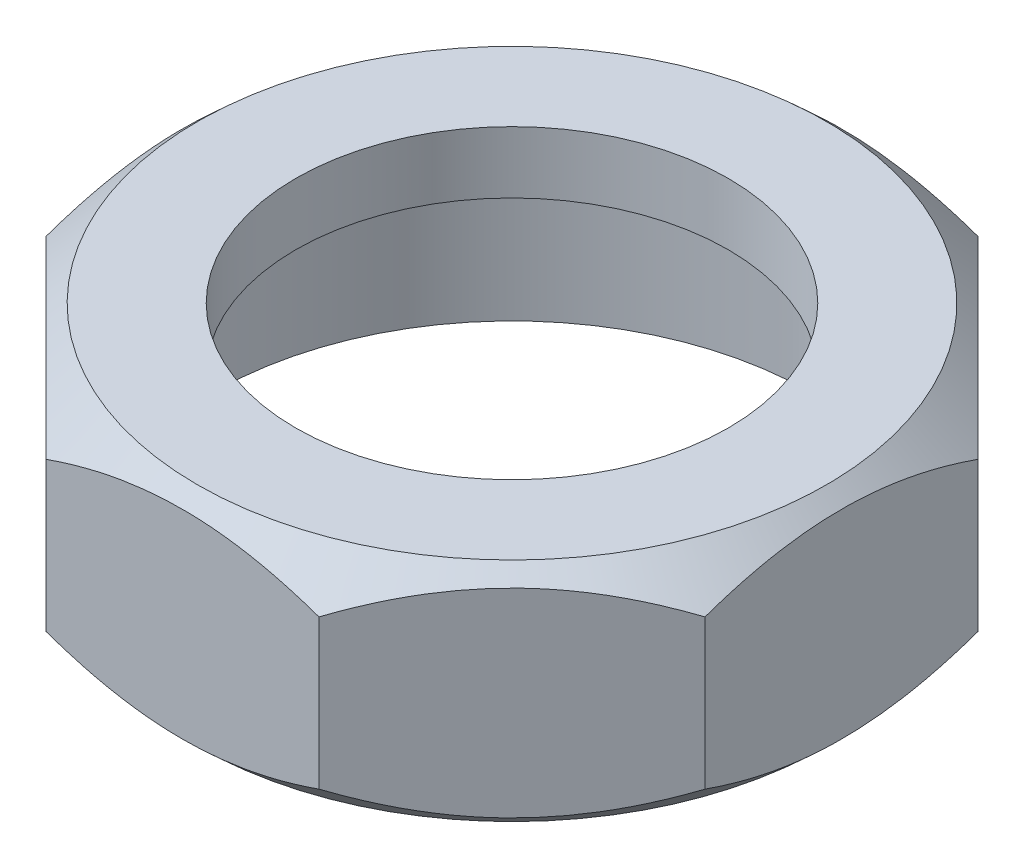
ISO-10303-21;
HEADER;
FILE_DESCRIPTION(('STEP AP214'),'2;1');
FILE_NAME('part.step','',(''),(''),'','','');
FILE_SCHEMA(('AUTOMOTIVE_DESIGN { 1 0 10303 214 1 1 1 1 }'));
ENDSEC;
DATA;
#1=APPLICATION_CONTEXT('core data for automotive mechanical design processes');
#2=APPLICATION_PROTOCOL_DEFINITION('international standard','automotive_design',2000,#1);
#3=PRODUCT_CONTEXT('',#1,'mechanical');
#4=PRODUCT('Part','Part','',(#3));
#5=PRODUCT_RELATED_PRODUCT_CATEGORY('part','',(#4));
#6=PRODUCT_DEFINITION_FORMATION('','',#4);
#7=PRODUCT_DEFINITION_CONTEXT('part definition',#1,'design');
#8=PRODUCT_DEFINITION('design','',#6,#7);
#9=PRODUCT_DEFINITION_SHAPE('','',#8);
#10=(LENGTH_UNIT() NAMED_UNIT(*) SI_UNIT(.MILLI.,.METRE.));
#11=(NAMED_UNIT(*) PLANE_ANGLE_UNIT() SI_UNIT($,.RADIAN.));
#12=(NAMED_UNIT(*) SI_UNIT($,.STERADIAN.) SOLID_ANGLE_UNIT());
#13=UNCERTAINTY_MEASURE_WITH_UNIT(LENGTH_MEASURE(1.E-05),#10,'distance_accuracy_value','');
#14=(GEOMETRIC_REPRESENTATION_CONTEXT(3) GLOBAL_UNCERTAINTY_ASSIGNED_CONTEXT((#13)) GLOBAL_UNIT_ASSIGNED_CONTEXT((#10,
#11,#12)) REPRESENTATION_CONTEXT('',''));
#15=CARTESIAN_POINT('',(0.,0.,0.));
#16=DIRECTION('',(0.,0.,1.));
#17=DIRECTION('',(1.,0.,0.));
#18=AXIS2_PLACEMENT_3D('',#15,#16,#17);
#19=CARTESIAN_POINT('',(0.,5.5,0.));
#20=DIRECTION('',(0.,-1.,0.));
#21=DIRECTION('',(0.,0.,-1.));
#22=AXIS2_PLACEMENT_3D('',#19,#20,#21);
#23=CYLINDRICAL_SURFACE('',#22,10.5);
#24=CARTESIAN_POINT('',(0.,5.5,0.));
#25=DIRECTION('',(0.,1.,0.));
#26=DIRECTION('',(0.,0.,1.));
#27=AXIS2_PLACEMENT_3D('',#24,#25,#26);
#28=CIRCLE('',#27,10.5);
#29=CARTESIAN_POINT('',(0.,5.5,10.5));
#30=VERTEX_POINT('',#29);
#31=EDGE_CURVE('E125',#30,#30,#28,.T.);
#32=ORIENTED_EDGE('',*,*,#31,.T.);
#33=EDGE_LOOP('',(#32));
#34=FACE_BOUND('',#33,.T.);
#35=CARTESIAN_POINT('',(0.,2.5,0.));
#36=DIRECTION('',(0.,-1.,0.));
#37=DIRECTION('',(0.,0.,-1.));
#38=AXIS2_PLACEMENT_3D('',#35,#36,#37);
#39=CIRCLE('',#38,10.5);
#40=CARTESIAN_POINT('',(0.,2.5,-10.5));
#41=VERTEX_POINT('',#40);
#42=EDGE_CURVE('E42',#41,#41,#39,.T.);
#43=ORIENTED_EDGE('',*,*,#42,.T.);
#44=EDGE_LOOP('',(#43));
#45=FACE_BOUND('',#44,.T.);
#46=ADVANCED_FACE('F37',(#34,#45),#23,.F.);
#47=CARTESIAN_POINT('',(0.,5.5,0.));
#48=DIRECTION('',(0.,1.,0.));
#49=DIRECTION('',(0.,0.,1.));
#50=AXIS2_PLACEMENT_3D('',#47,#48,#49);
#51=PLANE('',#50);
#52=ORIENTED_EDGE('',*,*,#31,.F.);
#53=EDGE_LOOP('',(#52));
#54=FACE_BOUND('',#53,.T.);
#55=CARTESIAN_POINT('',(0.,5.5,0.));
#56=DIRECTION('',(0.,1.,0.));
#57=DIRECTION('',(0.,0.,1.));
#58=AXIS2_PLACEMENT_3D('',#55,#56,#57);
#59=CIRCLE('',#58,15.274983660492);
#60=CARTESIAN_POINT('',(0.,5.5,15.274983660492));
#61=VERTEX_POINT('',#60);
#62=EDGE_CURVE('E241',#61,#61,#59,.T.);
#63=ORIENTED_EDGE('',*,*,#62,.T.);
#64=EDGE_LOOP('',(#63));
#65=FACE_BOUND('',#64,.T.);
#66=ADVANCED_FACE('F248',(#54,#65),#51,.T.);
#67=CARTESIAN_POINT('',(0.,-5.5,0.));
#68=DIRECTION('',(0.,1.,0.));
#69=DIRECTION('',(0.,0.,1.));
#70=AXIS2_PLACEMENT_3D('',#67,#68,#69);
#71=PLANE('',#70);
#72=CARTESIAN_POINT('',(0.,-5.5,0.));
#73=DIRECTION('',(0.,-1.,0.));
#74=DIRECTION('',(0.,0.,-1.));
#75=AXIS2_PLACEMENT_3D('',#72,#73,#74);
#76=CIRCLE('',#75,14.5);
#77=CARTESIAN_POINT('',(0.,-5.5,-14.5));
#78=VERTEX_POINT('',#77);
#79=EDGE_CURVE('E360',#78,#78,#76,.T.);
#80=ORIENTED_EDGE('',*,*,#79,.F.);
#81=EDGE_LOOP('',(#80));
#82=FACE_BOUND('',#81,.T.);
#83=CARTESIAN_POINT('',(0.,-5.5,0.));
#84=DIRECTION('',(0.,1.,0.));
#85=DIRECTION('',(0.,0.,1.));
#86=AXIS2_PLACEMENT_3D('',#83,#84,#85);
#87=CIRCLE('',#86,15.2749836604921);
#88=CARTESIAN_POINT('',(0.,-5.5,15.2749836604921));
#89=VERTEX_POINT('',#88);
#90=EDGE_CURVE('E261',#89,#89,#87,.T.);
#91=ORIENTED_EDGE('',*,*,#90,.F.);
#92=EDGE_LOOP('',(#91));
#93=FACE_BOUND('',#92,.T.);
#94=ADVANCED_FACE('F159',(#82,#93),#71,.F.);
#95=CARTESIAN_POINT('',(0.,-7.5,0.));
#96=DIRECTION('',(0.,1.,0.));
#97=DIRECTION('',(0.,0.,1.));
#98=AXIS2_PLACEMENT_3D('',#95,#96,#97);
#99=CONICAL_SURFACE('',#98,13.1,0.827286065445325);
#100=CARTESIAN_POINT('',(6.62721699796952,-3.6209975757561,-16.0002));
#101=CARTESIAN_POINT('',(6.82739295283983,-3.72062210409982,-15.8000240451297));
#102=CARTESIAN_POINT('',(7.02880233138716,-3.81540858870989,-15.5986146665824));
#103=CARTESIAN_POINT('',(7.4340594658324,-3.99427983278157,-15.1933575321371));
#104=CARTESIAN_POINT('',(7.63790808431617,-4.07836067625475,-14.9895089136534));
#105=CARTESIAN_POINT('',(8.04834995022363,-4.23490419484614,-14.5790670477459));
#106=CARTESIAN_POINT('',(8.25494851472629,-4.30733915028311,-14.3724684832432));
#107=CARTESIAN_POINT('',(8.67018209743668,-4.43929252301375,-13.9572349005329));
#108=CARTESIAN_POINT('',(8.87881687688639,-4.49881243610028,-13.7486001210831));
#109=CARTESIAN_POINT('',(9.29088514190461,-4.60223449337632,-13.3365318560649));
#110=CARTESIAN_POINT('',(9.49426162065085,-4.64658917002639,-13.1331553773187));
#111=CARTESIAN_POINT('',(9.90227362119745,-4.72158900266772,-12.7251433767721));
#112=CARTESIAN_POINT('',(10.1069090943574,-4.75223468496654,-12.5205079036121));
#113=CARTESIAN_POINT('',(10.5167563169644,-4.79924220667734,-12.1106606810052));
#114=CARTESIAN_POINT('',(10.7219670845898,-4.81562108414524,-11.9054499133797));
#115=CARTESIAN_POINT('',(11.1327075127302,-4.83385145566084,-11.4947094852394));
#116=CARTESIAN_POINT('',(11.3382371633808,-4.83570339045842,-11.2891798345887));
#117=CARTESIAN_POINT('',(11.7305652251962,-4.82533526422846,-10.8968517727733));
#118=CARTESIAN_POINT('',(11.9173805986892,-4.81436972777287,-10.7100363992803));
#119=CARTESIAN_POINT('',(12.2904784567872,-4.7805678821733,-10.3369385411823));
#120=CARTESIAN_POINT('',(12.4767608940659,-4.75773054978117,-10.1506561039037));
#121=CARTESIAN_POINT('',(13.0345886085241,-4.67182731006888,-9.5928283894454));
#122=CARTESIAN_POINT('',(13.4048488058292,-4.5913779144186,-9.22256819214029));
#123=CARTESIAN_POINT('',(14.1509987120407,-4.38536268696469,-8.47641828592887));
#124=CARTESIAN_POINT('',(14.5267004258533,-4.25846020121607,-8.10071657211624));
#125=CARTESIAN_POINT('',(15.0841138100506,-4.0395138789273,-7.54330318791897));
#126=CARTESIAN_POINT('',(15.268730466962,-3.96184966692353,-7.35868653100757));
#127=CARTESIAN_POINT('',(15.635960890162,-3.79778371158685,-6.9914561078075));
#128=CARTESIAN_POINT('',(15.8185751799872,-3.71138431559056,-6.80884181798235));
#129=CARTESIAN_POINT('',(16.0002,-3.62099757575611,-6.62721699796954));
#130=B_SPLINE_CURVE_WITH_KNOTS('',3,(#100,#101,#102,#103,#104,#105,#106,#107,#108,#109,#110,
#111,#112,#113,#114,#115,#116,#117,#118,#119,#120,#121,#122,#123,#124,#125,#126,#127,#128,#129),
.UNSPECIFIED.,.F.,.F.,(4,2,2,2,2,2,2,2,2,2,2,2,2,2,4),(0.,0.900343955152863,1.80101630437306,
2.70380168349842,3.60648244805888,4.47922301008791,5.35193006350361,6.22359345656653,
7.09523040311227,7.88822679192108,8.68129154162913,10.2685435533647,11.9056082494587,
12.7226604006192,13.5394935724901),.UNSPECIFIED.);
#131=CARTESIAN_POINT('',(6.62741699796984,-3.62109710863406,-16.));
#132=VERTEX_POINT('',#131);
#133=CARTESIAN_POINT('',(16.,-3.62109710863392,-6.62741699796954));
#134=VERTEX_POINT('',#133);
#135=EDGE_CURVE('E61',#132,#134,#130,.T.);
#136=ORIENTED_EDGE('',*,*,#135,.T.);
#137=CARTESIAN_POINT('',(16.,4.15703374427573,-20.2101476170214));
#138=CARTESIAN_POINT('',(16.,3.9878189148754,-19.9754372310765));
#139=CARTESIAN_POINT('',(16.,3.81934814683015,-19.7401908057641));
#140=CARTESIAN_POINT('',(16.,3.48403062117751,-19.268539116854));
#141=CARTESIAN_POINT('',(16.,3.31718388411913,-19.03213383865));
#142=CARTESIAN_POINT('',(16.,2.81923638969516,-18.3209820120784));
#143=CARTESIAN_POINT('',(16.,2.4907830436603,-17.8443751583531));
#144=CARTESIAN_POINT('',(16.,1.84064129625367,-16.8829863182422));
#145=CARTESIAN_POINT('',(16.,1.51899632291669,-16.3981749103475));
#146=CARTESIAN_POINT('',(16.,0.885995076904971,-15.421898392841));
#147=CARTESIAN_POINT('',(16.,0.57463828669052,-14.9304336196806));
#148=CARTESIAN_POINT('',(16.,-0.050646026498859,-13.9153211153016));
#149=CARTESIAN_POINT('',(16.,-0.36394146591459,-13.391282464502));
#150=CARTESIAN_POINT('',(16.,-0.973503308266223,-12.3332693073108));
#151=CARTESIAN_POINT('',(16.,-1.26976789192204,-11.7992937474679));
#152=CARTESIAN_POINT('',(16.,-1.84038747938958,-10.7210397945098));
#153=CARTESIAN_POINT('',(16.,-2.11478453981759,-10.1767837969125));
#154=CARTESIAN_POINT('',(16.,-2.63677709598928,-9.07564386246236));
#155=CARTESIAN_POINT('',(16.,-2.88438049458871,-8.51876370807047));
#156=CARTESIAN_POINT('',(16.,-3.33699932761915,-7.41313383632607));
#157=CARTESIAN_POINT('',(16.,-3.54329914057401,-6.86491412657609));
#158=CARTESIAN_POINT('',(16.,-3.91763410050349,-5.75525779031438));
#159=CARTESIAN_POINT('',(16.,-4.0856668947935,-5.19382035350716));
#160=CARTESIAN_POINT('',(16.,-4.3020812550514,-4.34659532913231));
#161=CARTESIAN_POINT('',(16.,-4.367958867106,-4.06522229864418));
#162=CARTESIAN_POINT('',(16.,-4.48755168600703,-3.49991627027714));
#163=CARTESIAN_POINT('',(16.,-4.54126841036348,-3.2159835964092));
#164=CARTESIAN_POINT('',(16.,-4.63571653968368,-2.64595628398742));
#165=CARTESIAN_POINT('',(16.,-4.6764478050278,-2.35986162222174));
#166=CARTESIAN_POINT('',(16.,-4.74423807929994,-1.78608571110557));
#167=CARTESIAN_POINT('',(16.,-4.77129884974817,-1.49840467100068));
#168=CARTESIAN_POINT('',(16.,-4.81155340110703,-0.917990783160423));
#169=CARTESIAN_POINT('',(16.,-4.82454624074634,-0.625243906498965));
#170=CARTESIAN_POINT('',(16.,-4.83573272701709,-0.0394662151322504));
#171=CARTESIAN_POINT('',(16.,-4.83392636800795,0.253564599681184));
#172=CARTESIAN_POINT('',(16.,-4.81554900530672,0.83916789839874));
#173=CARTESIAN_POINT('',(16.,-4.7989776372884,1.13174037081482));
#174=CARTESIAN_POINT('',(16.,-4.751384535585,1.71570226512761));
#175=CARTESIAN_POINT('',(16.,-4.72036269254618,2.0070916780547));
#176=CARTESIAN_POINT('',(16.,-4.64421545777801,2.58968030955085));
#177=CARTESIAN_POINT('',(16.,-4.59901187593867,2.8808692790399));
#178=CARTESIAN_POINT('',(16.,-4.49533211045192,3.46088864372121));
#179=CARTESIAN_POINT('',(16.,-4.43685413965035,3.7497187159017));
#180=CARTESIAN_POINT('',(16.,-4.24285299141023,4.61199941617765));
#181=CARTESIAN_POINT('',(16.,-4.088749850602,5.18133399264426));
#182=CARTESIAN_POINT('',(16.,-3.74372230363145,6.29189134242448));
#183=CARTESIAN_POINT('',(16.,-3.55388315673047,6.83345920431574));
#184=CARTESIAN_POINT('',(16.,-3.1419607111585,7.90432760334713));
#185=CARTESIAN_POINT('',(16.,-2.91986473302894,8.43362322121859));
#186=CARTESIAN_POINT('',(16.,-2.44930442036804,9.48122887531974));
#187=CARTESIAN_POINT('',(16.,-2.20080008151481,9.99952077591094));
#188=CARTESIAN_POINT('',(16.,-1.68281389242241,11.025367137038));
#189=CARTESIAN_POINT('',(16.,-1.41333455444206,11.532922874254));
#190=CARTESIAN_POINT('',(16.,-0.856177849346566,12.5408401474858));
#191=CARTESIAN_POINT('',(16.,-0.568425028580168,13.0411597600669));
#192=CARTESIAN_POINT('',(16.,0.0209868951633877,14.033523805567));
#193=CARTESIAN_POINT('',(16.,0.322646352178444,14.5255680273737));
#194=CARTESIAN_POINT('',(16.,0.937088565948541,15.5020657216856));
#195=CARTESIAN_POINT('',(16.,1.24986184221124,15.9865251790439));
#196=CARTESIAN_POINT('',(16.,1.88478353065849,16.9492279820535));
#197=CARTESIAN_POINT('',(16.,2.20693164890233,17.4274715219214));
#198=CARTESIAN_POINT('',(16.,2.66626907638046,18.0974097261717));
#199=CARTESIAN_POINT('',(16.,2.80020230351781,18.2913471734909));
#200=CARTESIAN_POINT('',(16.,3.06929174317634,18.6783777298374));
#201=CARTESIAN_POINT('',(16.,3.20444797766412,18.8714708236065));
#202=CARTESIAN_POINT('',(16.,3.47524127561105,19.2559268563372));
#203=CARTESIAN_POINT('',(16.,3.61087287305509,19.4472936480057));
#204=CARTESIAN_POINT('',(16.,3.88318458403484,19.8292738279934));
#205=CARTESIAN_POINT('',(16.,4.0198646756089,20.019887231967));
#206=CARTESIAN_POINT('',(16.,4.15703374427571,20.2101476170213));
#207=B_SPLINE_CURVE_WITH_KNOTS('',3,(#137,#138,#139,#140,#141,#142,#143,#144,#145,#146,#147,
#148,#149,#150,#151,#152,#153,#154,#155,#156,#157,#158,#159,#160,#161,#162,#163,#164,#165,#166,
#167,#168,#169,#170,#171,#172,#173,#174,#175,#176,#177,#178,#179,#180,#181,#182,#183,#184,#185,
#186,#187,#188,#189,#190,#191,#192,#193,#194,#195,#196,#197,#198,#199,#200,#201,#202,#203,#204,
#205,#206),.UNSPECIFIED.,.F.,.F.,(4,2,2,2,2,2,2,2,2,2,2,2,2,2,2,2,2,2,2,2,2,2,2,2,2,2,2,2,2,2,2,
2,2,2,4),(0.,0.868043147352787,1.73609726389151,3.47248561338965,5.21779533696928,
6.96301712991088,8.7944067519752,10.6259916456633,12.4539643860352,14.2813964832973,
16.0375545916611,17.7938206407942,18.6605452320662,19.527161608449,20.3937873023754,
21.260301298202,22.1390353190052,23.0177696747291,23.8965257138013,24.7752884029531,
25.6589838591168,26.5427983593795,28.3101453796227,30.030607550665,31.7517478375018,
33.475533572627,35.199113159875,36.9303418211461,38.6616145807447,40.3914443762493,
42.1212199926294,42.8282874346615,43.535367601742,44.2390363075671,44.9426903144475),.UNSPECIFIED.);
#208=CARTESIAN_POINT('',(16.,-3.62109710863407,6.62741699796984));
#209=VERTEX_POINT('',#208);
#210=EDGE_CURVE('E47',#134,#209,#207,.T.);
#211=ORIENTED_EDGE('',*,*,#210,.T.);
#212=CARTESIAN_POINT('',(16.0002,-3.62099757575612,6.62721699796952));
#213=CARTESIAN_POINT('',(15.8000240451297,-3.72062210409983,6.82739295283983));
#214=CARTESIAN_POINT('',(15.5986146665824,-3.8154085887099,7.02880233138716));
#215=CARTESIAN_POINT('',(15.1933575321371,-3.99427983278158,7.4340594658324));
#216=CARTESIAN_POINT('',(14.9895089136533,-4.07836067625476,7.63790808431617));
#217=CARTESIAN_POINT('',(14.5790670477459,-4.23490419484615,8.04834995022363));
#218=CARTESIAN_POINT('',(14.3724684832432,-4.30733915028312,8.25494851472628));
#219=CARTESIAN_POINT('',(13.9572349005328,-4.43929252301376,8.67018209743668));
#220=CARTESIAN_POINT('',(13.7486001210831,-4.49881243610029,8.87881687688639));
#221=CARTESIAN_POINT('',(13.3365318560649,-4.60223449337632,9.2908851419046));
#222=CARTESIAN_POINT('',(13.1331553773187,-4.6465891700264,9.49426162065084));
#223=CARTESIAN_POINT('',(12.7251433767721,-4.72158900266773,9.90227362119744));
#224=CARTESIAN_POINT('',(12.5205079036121,-4.75223468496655,10.1069090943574));
#225=CARTESIAN_POINT('',(12.1106606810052,-4.79924220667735,10.5167563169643));
#226=CARTESIAN_POINT('',(11.9054499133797,-4.81562108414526,10.7219670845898));
#227=CARTESIAN_POINT('',(11.4947094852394,-4.83385145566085,11.1327075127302));
#228=CARTESIAN_POINT('',(11.2891798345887,-4.83570339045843,11.3382371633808));
#229=CARTESIAN_POINT('',(10.8968517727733,-4.82533526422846,11.7305652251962));
#230=CARTESIAN_POINT('',(10.7100363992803,-4.81436972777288,11.9173805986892));
#231=CARTESIAN_POINT('',(10.3369385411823,-4.78056788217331,12.2904784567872));
#232=CARTESIAN_POINT('',(10.1506561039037,-4.75773054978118,12.4767608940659));
#233=CARTESIAN_POINT('',(9.59282838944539,-4.67182731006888,13.0345886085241));
#234=CARTESIAN_POINT('',(9.22256819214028,-4.59137791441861,13.4048488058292));
#235=CARTESIAN_POINT('',(8.47641828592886,-4.3853626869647,14.1509987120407));
#236=CARTESIAN_POINT('',(8.10071657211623,-4.25846020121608,14.5267004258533));
#237=CARTESIAN_POINT('',(7.54330318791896,-4.0395138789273,15.0841138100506));
#238=CARTESIAN_POINT('',(7.35868653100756,-3.96184966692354,15.268730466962));
#239=CARTESIAN_POINT('',(6.99145610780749,-3.79778371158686,15.635960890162));
#240=CARTESIAN_POINT('',(6.80884181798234,-3.71138431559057,15.8185751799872));
#241=CARTESIAN_POINT('',(6.62721699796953,-3.62099757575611,16.0002));
#242=B_SPLINE_CURVE_WITH_KNOTS('',3,(#212,#213,#214,#215,#216,#217,#218,#219,#220,#221,#222,
#223,#224,#225,#226,#227,#228,#229,#230,#231,#232,#233,#234,#235,#236,#237,#238,#239,#240,#241),
.UNSPECIFIED.,.F.,.F.,(4,2,2,2,2,2,2,2,2,2,2,2,2,2,4),(0.,0.900343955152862,1.80101630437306,
2.70380168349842,3.60648244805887,4.47922301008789,5.3519300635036,6.22359345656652,
7.09523040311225,7.88822679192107,8.68129154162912,10.2685435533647,11.9056082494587,
12.7226604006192,13.5394935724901),.UNSPECIFIED.);
#243=CARTESIAN_POINT('',(6.62741699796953,-3.62109710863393,16.));
#244=VERTEX_POINT('',#243);
#245=EDGE_CURVE('E103',#209,#244,#242,.T.);
#246=ORIENTED_EDGE('',*,*,#245,.T.);
#247=CARTESIAN_POINT('',(20.2101476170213,4.15703374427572,16.));
#248=CARTESIAN_POINT('',(19.9754372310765,3.98781891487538,16.));
#249=CARTESIAN_POINT('',(19.740190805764,3.81934814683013,16.));
#250=CARTESIAN_POINT('',(19.2685391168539,3.4840306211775,16.));
#251=CARTESIAN_POINT('',(19.03213383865,3.31718388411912,16.));
#252=CARTESIAN_POINT('',(18.3209820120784,2.81923638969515,16.));
#253=CARTESIAN_POINT('',(17.8443751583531,2.49078304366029,16.));
#254=CARTESIAN_POINT('',(16.8829863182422,1.84064129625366,16.));
#255=CARTESIAN_POINT('',(16.3981749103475,1.51899632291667,16.));
#256=CARTESIAN_POINT('',(15.421898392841,0.885995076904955,16.));
#257=CARTESIAN_POINT('',(14.9304336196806,0.574638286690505,16.));
#258=CARTESIAN_POINT('',(13.9153211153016,-0.0506460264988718,16.));
#259=CARTESIAN_POINT('',(13.391282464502,-0.363941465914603,16.));
#260=CARTESIAN_POINT('',(12.3332693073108,-0.973503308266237,16.));
#261=CARTESIAN_POINT('',(11.7992937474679,-1.26976789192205,16.));
#262=CARTESIAN_POINT('',(10.7210397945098,-1.8403874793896,16.));
#263=CARTESIAN_POINT('',(10.1767837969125,-2.1147845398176,16.));
#264=CARTESIAN_POINT('',(9.07564386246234,-2.63677709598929,16.));
#265=CARTESIAN_POINT('',(8.51876370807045,-2.88438049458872,16.));
#266=CARTESIAN_POINT('',(7.41313383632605,-3.33699932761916,16.));
#267=CARTESIAN_POINT('',(6.86491412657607,-3.54329914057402,16.));
#268=CARTESIAN_POINT('',(5.75525779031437,-3.9176341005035,16.));
#269=CARTESIAN_POINT('',(5.19382035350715,-4.08566689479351,16.));
#270=CARTESIAN_POINT('',(4.3465953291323,-4.30208125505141,16.));
#271=CARTESIAN_POINT('',(4.06522229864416,-4.36795886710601,16.));
#272=CARTESIAN_POINT('',(3.49991627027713,-4.48755168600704,16.));
#273=CARTESIAN_POINT('',(3.21598359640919,-4.54126841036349,16.));
#274=CARTESIAN_POINT('',(2.64595628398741,-4.63571653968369,16.));
#275=CARTESIAN_POINT('',(2.35986162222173,-4.67644780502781,16.));
#276=CARTESIAN_POINT('',(1.78608571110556,-4.74423807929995,16.));
#277=CARTESIAN_POINT('',(1.49840467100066,-4.77129884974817,16.));
#278=CARTESIAN_POINT('',(0.91799078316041,-4.81155340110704,16.));
#279=CARTESIAN_POINT('',(0.625243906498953,-4.82454624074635,16.));
#280=CARTESIAN_POINT('',(0.039466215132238,-4.83573272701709,16.));
#281=CARTESIAN_POINT('',(-0.253564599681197,-4.83392636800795,16.));
#282=CARTESIAN_POINT('',(-0.839167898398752,-4.81554900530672,16.));
#283=CARTESIAN_POINT('',(-1.13174037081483,-4.7989776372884,16.));
#284=CARTESIAN_POINT('',(-1.71570226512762,-4.751384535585,16.));
#285=CARTESIAN_POINT('',(-2.00709167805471,-4.72036269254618,16.));
#286=CARTESIAN_POINT('',(-2.58968030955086,-4.64421545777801,16.));
#287=CARTESIAN_POINT('',(-2.88086927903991,-4.59901187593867,16.));
#288=CARTESIAN_POINT('',(-3.46088864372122,-4.49533211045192,16.));
#289=CARTESIAN_POINT('',(-3.74971871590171,-4.43685413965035,16.));
#290=CARTESIAN_POINT('',(-4.61199941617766,-4.24285299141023,16.));
#291=CARTESIAN_POINT('',(-5.18133399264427,-4.088749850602,16.));
#292=CARTESIAN_POINT('',(-6.29189134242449,-3.74372230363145,16.));
#293=CARTESIAN_POINT('',(-6.83345920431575,-3.55388315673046,16.));
#294=CARTESIAN_POINT('',(-7.90432760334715,-3.1419607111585,16.));
#295=CARTESIAN_POINT('',(-8.43362322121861,-2.91986473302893,16.));
#296=CARTESIAN_POINT('',(-9.48122887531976,-2.44930442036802,16.));
#297=CARTESIAN_POINT('',(-9.99952077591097,-2.20080008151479,16.));
#298=CARTESIAN_POINT('',(-11.0253671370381,-1.6828138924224,16.));
#299=CARTESIAN_POINT('',(-11.532922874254,-1.41333455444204,16.));
#300=CARTESIAN_POINT('',(-12.5408401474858,-0.856177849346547,16.));
#301=CARTESIAN_POINT('',(-13.0411597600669,-0.568425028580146,16.));
#302=CARTESIAN_POINT('',(-14.033523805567,0.0209868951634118,16.));
#303=CARTESIAN_POINT('',(-14.5255680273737,0.322646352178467,16.));
#304=CARTESIAN_POINT('',(-15.5020657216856,0.937088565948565,16.));
#305=CARTESIAN_POINT('',(-15.9865251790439,1.24986184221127,16.));
#306=CARTESIAN_POINT('',(-16.9492279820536,1.88478353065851,16.));
#307=CARTESIAN_POINT('',(-17.4274715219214,2.20693164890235,16.));
#308=CARTESIAN_POINT('',(-18.0974097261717,2.66626907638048,16.));
#309=CARTESIAN_POINT('',(-18.2913471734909,2.80020230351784,16.));
#310=CARTESIAN_POINT('',(-18.6783777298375,3.06929174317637,16.));
#311=CARTESIAN_POINT('',(-18.8714708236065,3.20444797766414,16.));
#312=CARTESIAN_POINT('',(-19.2559268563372,3.47524127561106,16.));
#313=CARTESIAN_POINT('',(-19.4472936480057,3.6108728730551,16.));
#314=CARTESIAN_POINT('',(-19.8292738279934,3.88318458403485,16.));
#315=CARTESIAN_POINT('',(-20.019887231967,4.01986467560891,16.));
#316=CARTESIAN_POINT('',(-20.2101476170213,4.15703374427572,16.));
#317=B_SPLINE_CURVE_WITH_KNOTS('',3,(#247,#248,#249,#250,#251,#252,#253,#254,#255,#256,#257,
#258,#259,#260,#261,#262,#263,#264,#265,#266,#267,#268,#269,#270,#271,#272,#273,#274,#275,#276,
#277,#278,#279,#280,#281,#282,#283,#284,#285,#286,#287,#288,#289,#290,#291,#292,#293,#294,#295,
#296,#297,#298,#299,#300,#301,#302,#303,#304,#305,#306,#307,#308,#309,#310,#311,#312,#313,#314,
#315,#316),.UNSPECIFIED.,.F.,.F.,(4,2,2,2,2,2,2,2,2,2,2,2,2,2,2,2,2,2,2,2,2,2,2,2,2,2,2,2,2,2,2,
2,2,2,4),(0.,0.868043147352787,1.73609726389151,3.47248561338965,5.21779533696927,
6.96301712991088,8.79440675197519,10.6259916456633,12.4539643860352,14.2813964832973,
16.0375545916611,17.7938206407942,18.6605452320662,19.527161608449,20.3937873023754,
21.260301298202,22.1390353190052,23.0177696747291,23.8965257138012,24.7752884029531,
25.6589838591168,26.5427983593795,28.3101453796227,30.030607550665,31.7517478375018,
33.475533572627,35.199113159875,36.9303418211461,38.6616145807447,40.3914443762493,
42.1212199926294,42.8282874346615,43.535367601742,44.2390363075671,44.9426903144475),.UNSPECIFIED.);
#318=CARTESIAN_POINT('',(-6.62741699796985,-3.62109710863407,16.));
#319=VERTEX_POINT('',#318);
#320=EDGE_CURVE('E118',#244,#319,#317,.T.);
#321=ORIENTED_EDGE('',*,*,#320,.T.);
#322=CARTESIAN_POINT('',(-6.62721699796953,-3.62099757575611,16.0002));
#323=CARTESIAN_POINT('',(-6.82739295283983,-3.72062210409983,15.8000240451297));
#324=CARTESIAN_POINT('',(-7.02880233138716,-3.8154085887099,15.5986146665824));
#325=CARTESIAN_POINT('',(-7.4340594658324,-3.99427983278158,15.1933575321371));
#326=CARTESIAN_POINT('',(-7.63790808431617,-4.07836067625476,14.9895089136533));
#327=CARTESIAN_POINT('',(-8.04834995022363,-4.23490419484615,14.5790670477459));
#328=CARTESIAN_POINT('',(-8.25494851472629,-4.30733915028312,14.3724684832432));
#329=CARTESIAN_POINT('',(-8.67018209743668,-4.43929252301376,13.9572349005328));
#330=CARTESIAN_POINT('',(-8.8788168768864,-4.49881243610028,13.7486001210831));
#331=CARTESIAN_POINT('',(-9.29088514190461,-4.60223449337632,13.3365318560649));
#332=CARTESIAN_POINT('',(-9.49426162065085,-4.6465891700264,13.1331553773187));
#333=CARTESIAN_POINT('',(-9.90227362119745,-4.72158900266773,12.7251433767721));
#334=CARTESIAN_POINT('',(-10.1069090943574,-4.75223468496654,12.5205079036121));
#335=CARTESIAN_POINT('',(-10.5167563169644,-4.79924220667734,12.1106606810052));
#336=CARTESIAN_POINT('',(-10.7219670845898,-4.81562108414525,11.9054499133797));
#337=CARTESIAN_POINT('',(-11.1327075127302,-4.83385145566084,11.4947094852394));
#338=CARTESIAN_POINT('',(-11.3382371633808,-4.83570339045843,11.2891798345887));
#339=CARTESIAN_POINT('',(-11.7305652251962,-4.82533526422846,10.8968517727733));
#340=CARTESIAN_POINT('',(-11.9173805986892,-4.81436972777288,10.7100363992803));
#341=CARTESIAN_POINT('',(-12.2904784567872,-4.7805678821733,10.3369385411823));
#342=CARTESIAN_POINT('',(-12.4767608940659,-4.75773054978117,10.1506561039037));
#343=CARTESIAN_POINT('',(-13.0345886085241,-4.67182731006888,9.59282838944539));
#344=CARTESIAN_POINT('',(-13.4048488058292,-4.5913779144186,9.22256819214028));
#345=CARTESIAN_POINT('',(-14.1509987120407,-4.38536268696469,8.47641828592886));
#346=CARTESIAN_POINT('',(-14.5267004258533,-4.25846020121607,8.10071657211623));
#347=CARTESIAN_POINT('',(-15.0841138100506,-4.0395138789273,7.54330318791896));
#348=CARTESIAN_POINT('',(-15.268730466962,-3.96184966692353,7.35868653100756));
#349=CARTESIAN_POINT('',(-15.635960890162,-3.79778371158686,6.99145610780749));
#350=CARTESIAN_POINT('',(-15.8185751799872,-3.71138431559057,6.80884181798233));
#351=CARTESIAN_POINT('',(-16.0002,-3.62099757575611,6.62721699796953));
#352=B_SPLINE_CURVE_WITH_KNOTS('',3,(#322,#323,#324,#325,#326,#327,#328,#329,#330,#331,#332,
#333,#334,#335,#336,#337,#338,#339,#340,#341,#342,#343,#344,#345,#346,#347,#348,#349,#350,#351),
.UNSPECIFIED.,.F.,.F.,(4,2,2,2,2,2,2,2,2,2,2,2,2,2,4),(0.,0.900343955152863,1.80101630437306,
2.70380168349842,3.60648244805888,4.4792230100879,5.3519300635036,6.22359345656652,
7.09523040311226,7.88822679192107,8.68129154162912,10.2685435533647,11.9056082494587,
12.7226604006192,13.5394935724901),.UNSPECIFIED.);
#353=CARTESIAN_POINT('',(-16.,-3.62109710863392,6.62741699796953));
#354=VERTEX_POINT('',#353);
#355=EDGE_CURVE('E182',#319,#354,#352,.T.);
#356=ORIENTED_EDGE('',*,*,#355,.T.);
#357=CARTESIAN_POINT('',(-16.,4.15703374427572,20.2101476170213));
#358=CARTESIAN_POINT('',(-16.,3.98781891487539,19.9754372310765));
#359=CARTESIAN_POINT('',(-16.,3.81934814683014,19.740190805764));
#360=CARTESIAN_POINT('',(-16.,3.48403062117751,19.2685391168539));
#361=CARTESIAN_POINT('',(-16.,3.31718388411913,19.03213383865));
#362=CARTESIAN_POINT('',(-16.,2.81923638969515,18.3209820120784));
#363=CARTESIAN_POINT('',(-16.,2.4907830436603,17.8443751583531));
#364=CARTESIAN_POINT('',(-16.,1.84064129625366,16.8829863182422));
#365=CARTESIAN_POINT('',(-16.,1.51899632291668,16.3981749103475));
#366=CARTESIAN_POINT('',(-16.,0.88599507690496,15.421898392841));
#367=CARTESIAN_POINT('',(-16.,0.574638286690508,14.9304336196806));
#368=CARTESIAN_POINT('',(-16.,-0.0506460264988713,13.9153211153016));
#369=CARTESIAN_POINT('',(-16.,-0.363941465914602,13.391282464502));
#370=CARTESIAN_POINT('',(-16.,-0.973503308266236,12.3332693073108));
#371=CARTESIAN_POINT('',(-16.,-1.26976789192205,11.7992937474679));
#372=CARTESIAN_POINT('',(-16.,-1.8403874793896,10.7210397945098));
#373=CARTESIAN_POINT('',(-16.,-2.1147845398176,10.1767837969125));
#374=CARTESIAN_POINT('',(-16.,-2.63677709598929,9.07564386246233));
#375=CARTESIAN_POINT('',(-16.,-2.88438049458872,8.51876370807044));
#376=CARTESIAN_POINT('',(-16.,-3.33699932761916,7.41313383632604));
#377=CARTESIAN_POINT('',(-16.,-3.54329914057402,6.86491412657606));
#378=CARTESIAN_POINT('',(-16.,-3.9176341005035,5.75525779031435));
#379=CARTESIAN_POINT('',(-16.,-4.0856668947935,5.19382035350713));
#380=CARTESIAN_POINT('',(-16.,-4.3020812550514,4.34659532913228));
#381=CARTESIAN_POINT('',(-16.,-4.367958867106,4.06522229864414));
#382=CARTESIAN_POINT('',(-16.,-4.48755168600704,3.49991627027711));
#383=CARTESIAN_POINT('',(-16.,-4.54126841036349,3.21598359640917));
#384=CARTESIAN_POINT('',(-16.,-4.63571653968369,2.64595628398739));
#385=CARTESIAN_POINT('',(-16.,-4.6764478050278,2.35986162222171));
#386=CARTESIAN_POINT('',(-16.,-4.74423807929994,1.78608571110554));
#387=CARTESIAN_POINT('',(-16.,-4.77129884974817,1.49840467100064));
#388=CARTESIAN_POINT('',(-16.,-4.81155340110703,0.91799078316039));
#389=CARTESIAN_POINT('',(-16.,-4.82454624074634,0.625243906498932));
#390=CARTESIAN_POINT('',(-16.,-4.83573272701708,0.0394662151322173));
#391=CARTESIAN_POINT('',(-16.,-4.83392636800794,-0.253564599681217));
#392=CARTESIAN_POINT('',(-16.,-4.81554900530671,-0.839167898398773));
#393=CARTESIAN_POINT('',(-16.,-4.7989776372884,-1.13174037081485));
#394=CARTESIAN_POINT('',(-16.,-4.75138453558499,-1.71570226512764));
#395=CARTESIAN_POINT('',(-16.,-4.72036269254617,-2.00709167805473));
#396=CARTESIAN_POINT('',(-16.,-4.644215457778,-2.58968030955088));
#397=CARTESIAN_POINT('',(-16.,-4.59901187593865,-2.88086927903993));
#398=CARTESIAN_POINT('',(-16.,-4.49533211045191,-3.46088864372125));
#399=CARTESIAN_POINT('',(-16.,-4.43685413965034,-3.74971871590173));
#400=CARTESIAN_POINT('',(-16.,-4.24285299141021,-4.61199941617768));
#401=CARTESIAN_POINT('',(-16.,-4.08874985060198,-5.18133399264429));
#402=CARTESIAN_POINT('',(-16.,-3.74372230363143,-6.29189134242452));
#403=CARTESIAN_POINT('',(-16.,-3.55388315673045,-6.83345920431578));
#404=CARTESIAN_POINT('',(-16.,-3.14196071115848,-7.90432760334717));
#405=CARTESIAN_POINT('',(-16.,-2.91986473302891,-8.43362322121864));
#406=CARTESIAN_POINT('',(-16.,-2.44930442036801,-9.48122887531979));
#407=CARTESIAN_POINT('',(-16.,-2.20080008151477,-9.99952077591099));
#408=CARTESIAN_POINT('',(-16.,-1.68281389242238,-11.0253671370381));
#409=CARTESIAN_POINT('',(-16.,-1.41333455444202,-11.532922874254));
#410=CARTESIAN_POINT('',(-16.,-0.856177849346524,-12.5408401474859));
#411=CARTESIAN_POINT('',(-16.,-0.568425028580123,-13.041159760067));
#412=CARTESIAN_POINT('',(-16.,0.0209868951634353,-14.033523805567));
#413=CARTESIAN_POINT('',(-16.,0.322646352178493,-14.5255680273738));
#414=CARTESIAN_POINT('',(-16.,0.937088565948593,-15.5020657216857));
#415=CARTESIAN_POINT('',(-16.,1.2498618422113,-15.9865251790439));
#416=CARTESIAN_POINT('',(-16.,1.88478353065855,-16.9492279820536));
#417=CARTESIAN_POINT('',(-16.,2.20693164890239,-17.4274715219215));
#418=CARTESIAN_POINT('',(-16.,2.66626907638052,-18.0974097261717));
#419=CARTESIAN_POINT('',(-16.,2.80020230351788,-18.2913471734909));
#420=CARTESIAN_POINT('',(-16.,3.06929174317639,-18.6783777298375));
#421=CARTESIAN_POINT('',(-16.,3.20444797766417,-18.8714708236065));
#422=CARTESIAN_POINT('',(-16.,3.47524127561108,-19.2559268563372));
#423=CARTESIAN_POINT('',(-16.,3.61087287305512,-19.4472936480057));
#424=CARTESIAN_POINT('',(-16.,3.88318458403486,-19.8292738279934));
#425=CARTESIAN_POINT('',(-16.,4.01986467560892,-20.019887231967));
#426=CARTESIAN_POINT('',(-16.,4.15703374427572,-20.2101476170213));
#427=B_SPLINE_CURVE_WITH_KNOTS('',3,(#357,#358,#359,#360,#361,#362,#363,#364,#365,#366,#367,
#368,#369,#370,#371,#372,#373,#374,#375,#376,#377,#378,#379,#380,#381,#382,#383,#384,#385,#386,
#387,#388,#389,#390,#391,#392,#393,#394,#395,#396,#397,#398,#399,#400,#401,#402,#403,#404,#405,
#406,#407,#408,#409,#410,#411,#412,#413,#414,#415,#416,#417,#418,#419,#420,#421,#422,#423,#424,
#425,#426),.UNSPECIFIED.,.F.,.F.,(4,2,2,2,2,2,2,2,2,2,2,2,2,2,2,2,2,2,2,2,2,2,2,2,2,2,2,2,2,2,2,
2,2,2,4),(0.,0.868043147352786,1.73609726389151,3.47248561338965,5.21779533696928,
6.96301712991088,8.79440675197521,10.6259916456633,12.4539643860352,14.2813964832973,
16.0375545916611,17.7938206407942,18.6605452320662,19.527161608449,20.3937873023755,
21.260301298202,22.1390353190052,23.0177696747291,23.8965257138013,24.7752884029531,
25.6589838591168,26.5427983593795,28.3101453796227,30.030607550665,31.7517478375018,
33.475533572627,35.199113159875,36.9303418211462,38.6616145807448,40.3914443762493,
42.1212199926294,42.8282874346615,43.5353676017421,44.2390363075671,44.9426903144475),.UNSPECIFIED.);
#428=CARTESIAN_POINT('',(-16.,-3.62109710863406,-6.62741699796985));
#429=VERTEX_POINT('',#428);
#430=EDGE_CURVE('E190',#354,#429,#427,.T.);
#431=ORIENTED_EDGE('',*,*,#430,.T.);
#432=CARTESIAN_POINT('',(-16.0002,-3.62099757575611,-6.62721699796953));
#433=CARTESIAN_POINT('',(-15.8000240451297,-3.72062210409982,-6.82739295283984));
#434=CARTESIAN_POINT('',(-15.5986146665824,-3.81540858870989,-7.02880233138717));
#435=CARTESIAN_POINT('',(-15.1933575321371,-3.99427983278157,-7.43405946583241));
#436=CARTESIAN_POINT('',(-14.9895089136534,-4.07836067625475,-7.63790808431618));
#437=CARTESIAN_POINT('',(-14.5790670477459,-4.23490419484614,-8.04834995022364));
#438=CARTESIAN_POINT('',(-14.3724684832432,-4.30733915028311,-8.25494851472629));
#439=CARTESIAN_POINT('',(-13.9572349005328,-4.43929252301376,-8.67018209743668));
#440=CARTESIAN_POINT('',(-13.7486001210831,-4.49881243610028,-8.8788168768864));
#441=CARTESIAN_POINT('',(-13.3365318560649,-4.60223449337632,-9.29088514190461));
#442=CARTESIAN_POINT('',(-13.1331553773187,-4.64658917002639,-9.49426162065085));
#443=CARTESIAN_POINT('',(-12.7251433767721,-4.72158900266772,-9.90227362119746));
#444=CARTESIAN_POINT('',(-12.5205079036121,-4.75223468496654,-10.1069090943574));
#445=CARTESIAN_POINT('',(-12.1106606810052,-4.79924220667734,-10.5167563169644));
#446=CARTESIAN_POINT('',(-11.9054499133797,-4.81562108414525,-10.7219670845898));
#447=CARTESIAN_POINT('',(-11.4947094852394,-4.83385145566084,-11.1327075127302));
#448=CARTESIAN_POINT('',(-11.2891798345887,-4.83570339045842,-11.3382371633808));
#449=CARTESIAN_POINT('',(-10.8968517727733,-4.82533526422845,-11.7305652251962));
#450=CARTESIAN_POINT('',(-10.7100363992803,-4.81436972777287,-11.9173805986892));
#451=CARTESIAN_POINT('',(-10.3369385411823,-4.7805678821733,-12.2904784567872));
#452=CARTESIAN_POINT('',(-10.1506561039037,-4.75773054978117,-12.4767608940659));
#453=CARTESIAN_POINT('',(-9.5928283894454,-4.67182731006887,-13.0345886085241));
#454=CARTESIAN_POINT('',(-9.22256819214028,-4.5913779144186,-13.4048488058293));
#455=CARTESIAN_POINT('',(-8.47641828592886,-4.38536268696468,-14.1509987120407));
#456=CARTESIAN_POINT('',(-8.10071657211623,-4.25846020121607,-14.5267004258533));
#457=CARTESIAN_POINT('',(-7.54330318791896,-4.03951387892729,-15.0841138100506));
#458=CARTESIAN_POINT('',(-7.35868653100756,-3.96184966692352,-15.268730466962));
#459=CARTESIAN_POINT('',(-6.99145610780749,-3.79778371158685,-15.635960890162));
#460=CARTESIAN_POINT('',(-6.80884181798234,-3.71138431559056,-15.8185751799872));
#461=CARTESIAN_POINT('',(-6.62721699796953,-3.6209975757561,-16.0002));
#462=B_SPLINE_CURVE_WITH_KNOTS('',3,(#432,#433,#434,#435,#436,#437,#438,#439,#440,#441,#442,
#443,#444,#445,#446,#447,#448,#449,#450,#451,#452,#453,#454,#455,#456,#457,#458,#459,#460,#461),
.UNSPECIFIED.,.F.,.F.,(4,2,2,2,2,2,2,2,2,2,2,2,2,2,4),(0.,0.900343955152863,1.80101630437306,
2.70380168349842,3.60648244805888,4.4792230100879,5.35193006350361,6.22359345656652,
7.09523040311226,7.88822679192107,8.68129154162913,10.2685435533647,11.9056082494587,
12.7226604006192,13.5394935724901),.UNSPECIFIED.);
#463=CARTESIAN_POINT('',(-6.62741699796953,-3.62109710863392,-16.));
#464=VERTEX_POINT('',#463);
#465=EDGE_CURVE('E197',#429,#464,#462,.T.);
#466=ORIENTED_EDGE('',*,*,#465,.T.);
#467=CARTESIAN_POINT('',(-20.2101476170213,4.15703374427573,-16.));
#468=CARTESIAN_POINT('',(-19.9754372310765,3.98781891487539,-16.));
#469=CARTESIAN_POINT('',(-19.740190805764,3.81934814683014,-16.));
#470=CARTESIAN_POINT('',(-19.2685391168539,3.48403062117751,-16.));
#471=CARTESIAN_POINT('',(-19.03213383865,3.31718388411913,-16.));
#472=CARTESIAN_POINT('',(-18.3209820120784,2.81923638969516,-16.));
#473=CARTESIAN_POINT('',(-17.8443751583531,2.4907830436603,-16.));
#474=CARTESIAN_POINT('',(-16.8829863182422,1.84064129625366,-16.));
#475=CARTESIAN_POINT('',(-16.3981749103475,1.51899632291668,-16.));
#476=CARTESIAN_POINT('',(-15.421898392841,0.885995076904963,-16.));
#477=CARTESIAN_POINT('',(-14.9304336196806,0.574638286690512,-16.));
#478=CARTESIAN_POINT('',(-13.9153211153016,-0.0506460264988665,-16.));
#479=CARTESIAN_POINT('',(-13.391282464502,-0.363941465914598,-16.));
#480=CARTESIAN_POINT('',(-12.3332693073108,-0.97350330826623,-16.));
#481=CARTESIAN_POINT('',(-11.7992937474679,-1.26976789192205,-16.));
#482=CARTESIAN_POINT('',(-10.7210397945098,-1.84038747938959,-16.));
#483=CARTESIAN_POINT('',(-10.1767837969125,-2.11478453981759,-16.));
#484=CARTESIAN_POINT('',(-9.07564386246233,-2.63677709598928,-16.));
#485=CARTESIAN_POINT('',(-8.51876370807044,-2.88438049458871,-16.));
#486=CARTESIAN_POINT('',(-7.41313383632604,-3.33699932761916,-16.));
#487=CARTESIAN_POINT('',(-6.86491412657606,-3.54329914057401,-16.));
#488=CARTESIAN_POINT('',(-5.75525779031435,-3.91763410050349,-16.));
#489=CARTESIAN_POINT('',(-5.19382035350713,-4.0856668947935,-16.));
#490=CARTESIAN_POINT('',(-4.34659532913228,-4.3020812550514,-16.));
#491=CARTESIAN_POINT('',(-4.06522229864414,-4.36795886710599,-16.));
#492=CARTESIAN_POINT('',(-3.4999162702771,-4.48755168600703,-16.));
#493=CARTESIAN_POINT('',(-3.21598359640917,-4.54126841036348,-16.));
#494=CARTESIAN_POINT('',(-2.64595628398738,-4.63571653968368,-16.));
#495=CARTESIAN_POINT('',(-2.35986162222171,-4.6764478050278,-16.));
#496=CARTESIAN_POINT('',(-1.78608571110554,-4.74423807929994,-16.));
#497=CARTESIAN_POINT('',(-1.49840467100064,-4.77129884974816,-16.));
#498=CARTESIAN_POINT('',(-0.917990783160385,-4.81155340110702,-16.));
#499=CARTESIAN_POINT('',(-0.625243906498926,-4.82454624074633,-16.));
#500=CARTESIAN_POINT('',(-0.0394662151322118,-4.83573272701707,-16.));
#501=CARTESIAN_POINT('',(0.253564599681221,-4.83392636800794,-16.));
#502=CARTESIAN_POINT('',(0.839167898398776,-4.81554900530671,-16.));
#503=CARTESIAN_POINT('',(1.13174037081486,-4.79897763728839,-16.));
#504=CARTESIAN_POINT('',(1.71570226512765,-4.75138453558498,-16.));
#505=CARTESIAN_POINT('',(2.00709167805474,-4.72036269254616,-16.));
#506=CARTESIAN_POINT('',(2.58968030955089,-4.64421545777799,-16.));
#507=CARTESIAN_POINT('',(2.88086927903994,-4.59901187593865,-16.));
#508=CARTESIAN_POINT('',(3.46088864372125,-4.4953321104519,-16.));
#509=CARTESIAN_POINT('',(3.74971871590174,-4.43685413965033,-16.));
#510=CARTESIAN_POINT('',(4.61199941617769,-4.2428529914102,-16.));
#511=CARTESIAN_POINT('',(5.1813339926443,-4.08874985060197,-16.));
#512=CARTESIAN_POINT('',(6.29189134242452,-3.74372230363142,-16.));
#513=CARTESIAN_POINT('',(6.83345920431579,-3.55388315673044,-16.));
#514=CARTESIAN_POINT('',(7.90432760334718,-3.14196071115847,-16.));
#515=CARTESIAN_POINT('',(8.43362322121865,-2.9198647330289,-16.));
#516=CARTESIAN_POINT('',(9.4812288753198,-2.44930442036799,-16.));
#517=CARTESIAN_POINT('',(9.99952077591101,-2.20080008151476,-16.));
#518=CARTESIAN_POINT('',(11.0253671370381,-1.68281389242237,-16.));
#519=CARTESIAN_POINT('',(11.5329228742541,-1.413334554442,-16.));
#520=CARTESIAN_POINT('',(12.5408401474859,-0.856177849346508,-16.));
#521=CARTESIAN_POINT('',(13.041159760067,-0.568425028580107,-16.));
#522=CARTESIAN_POINT('',(14.033523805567,0.0209868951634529,-16.));
#523=CARTESIAN_POINT('',(14.5255680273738,0.322646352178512,-16.));
#524=CARTESIAN_POINT('',(15.5020657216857,0.937088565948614,-16.));
#525=CARTESIAN_POINT('',(15.986525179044,1.24986184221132,-16.));
#526=CARTESIAN_POINT('',(16.9492279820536,1.88478353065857,-16.));
#527=CARTESIAN_POINT('',(17.4274715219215,2.20693164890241,-16.));
#528=CARTESIAN_POINT('',(18.0974097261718,2.66626907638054,-16.));
#529=CARTESIAN_POINT('',(18.291347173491,2.80020230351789,-16.));
#530=CARTESIAN_POINT('',(18.6783777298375,3.06929174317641,-16.));
#531=CARTESIAN_POINT('',(18.8714708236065,3.20444797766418,-16.));
#532=CARTESIAN_POINT('',(19.2559268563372,3.47524127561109,-16.));
#533=CARTESIAN_POINT('',(19.4472936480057,3.61087287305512,-16.));
#534=CARTESIAN_POINT('',(19.8292738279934,3.88318458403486,-16.));
#535=CARTESIAN_POINT('',(20.019887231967,4.01986467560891,-16.));
#536=CARTESIAN_POINT('',(20.2101476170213,4.15703374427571,-16.));
#537=B_SPLINE_CURVE_WITH_KNOTS('',3,(#467,#468,#469,#470,#471,#472,#473,#474,#475,#476,#477,
#478,#479,#480,#481,#482,#483,#484,#485,#486,#487,#488,#489,#490,#491,#492,#493,#494,#495,#496,
#497,#498,#499,#500,#501,#502,#503,#504,#505,#506,#507,#508,#509,#510,#511,#512,#513,#514,#515,
#516,#517,#518,#519,#520,#521,#522,#523,#524,#525,#526,#527,#528,#529,#530,#531,#532,#533,#534,
#535,#536),.UNSPECIFIED.,.F.,.F.,(4,2,2,2,2,2,2,2,2,2,2,2,2,2,2,2,2,2,2,2,2,2,2,2,2,2,2,2,2,2,2,
2,2,2,4),(0.,0.868043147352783,1.73609726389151,3.47248561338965,5.21779533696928,
6.96301712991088,8.79440675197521,10.6259916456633,12.4539643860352,14.2813964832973,
16.0375545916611,17.7938206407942,18.6605452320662,19.527161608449,20.3937873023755,
21.260301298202,22.1390353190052,23.0177696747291,23.8965257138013,24.7752884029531,
25.6589838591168,26.5427983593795,28.3101453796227,30.030607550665,31.7517478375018,
33.475533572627,35.199113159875,36.9303418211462,38.6616145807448,40.3914443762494,
42.1212199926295,42.8282874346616,43.5353676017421,44.2390363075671,44.9426903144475),.UNSPECIFIED.);
#538=EDGE_CURVE('E204',#464,#132,#537,.T.);
#539=ORIENTED_EDGE('',*,*,#538,.T.);
#540=EDGE_LOOP('',(#136,#211,#246,#321,#356,#431,#466,#539));
#541=FACE_BOUND('',#540,.T.);
#542=ORIENTED_EDGE('',*,*,#90,.T.);
#543=EDGE_LOOP('',(#542));
#544=FACE_BOUND('',#543,.T.);
#545=ADVANCED_FACE('F101',(#541,#544),#99,.T.);
#546=CARTESIAN_POINT('',(0.,2.53444545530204,0.));
#547=DIRECTION('',(0.,-1.,0.));
#548=DIRECTION('',(0.,0.,-1.));
#549=AXIS2_PLACEMENT_3D('',#546,#547,#548);
#550=CONICAL_SURFACE('',#549,18.5,0.827286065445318);
#551=ORIENTED_EDGE('',*,*,#62,.F.);
#552=EDGE_LOOP('',(#551));
#553=FACE_BOUND('',#552,.T.);
#554=CARTESIAN_POINT('',(16.0002,3.62099757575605,-6.62721699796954));
#555=CARTESIAN_POINT('',(15.8000240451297,3.72062210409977,-6.82739295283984));
#556=CARTESIAN_POINT('',(15.5986146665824,3.81540858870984,-7.02880233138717));
#557=CARTESIAN_POINT('',(15.1933575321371,3.99427983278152,-7.4340594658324));
#558=CARTESIAN_POINT('',(14.9895089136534,4.0783606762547,-7.63790808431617));
#559=CARTESIAN_POINT('',(14.5790670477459,4.23490419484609,-8.04834995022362));
#560=CARTESIAN_POINT('',(14.3724684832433,4.30733915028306,-8.25494851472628));
#561=CARTESIAN_POINT('',(13.9572349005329,4.43929252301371,-8.67018209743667));
#562=CARTESIAN_POINT('',(13.7486001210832,4.49881243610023,-8.87881687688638));
#563=CARTESIAN_POINT('',(13.3365318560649,4.60223449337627,-9.29088514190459));
#564=CARTESIAN_POINT('',(13.1331553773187,4.64658917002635,-9.49426162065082));
#565=CARTESIAN_POINT('',(12.7251433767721,4.72158900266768,-9.90227362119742));
#566=CARTESIAN_POINT('',(12.5205079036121,4.75223468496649,-10.1069090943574));
#567=CARTESIAN_POINT('',(12.1106606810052,4.79924220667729,-10.5167563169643));
#568=CARTESIAN_POINT('',(11.9054499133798,4.8156210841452,-10.7219670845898));
#569=CARTESIAN_POINT('',(11.4947094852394,4.8338514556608,-11.1327075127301));
#570=CARTESIAN_POINT('',(11.2891798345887,4.83570339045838,-11.3382371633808));
#571=CARTESIAN_POINT('',(10.8968517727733,4.82533526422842,-11.7305652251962));
#572=CARTESIAN_POINT('',(10.7100363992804,4.81436972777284,-11.9173805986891));
#573=CARTESIAN_POINT('',(10.3369385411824,4.78056788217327,-12.2904784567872));
#574=CARTESIAN_POINT('',(10.1506561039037,4.75773054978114,-12.4767608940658));
#575=CARTESIAN_POINT('',(9.59282838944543,4.67182731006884,-13.0345886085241));
#576=CARTESIAN_POINT('',(9.22256819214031,4.59137791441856,-13.4048488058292));
#577=CARTESIAN_POINT('',(8.47641828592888,4.38536268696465,-14.1509987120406));
#578=CARTESIAN_POINT('',(8.10071657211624,4.25846020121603,-14.5267004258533));
#579=CARTESIAN_POINT('',(7.54330318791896,4.03951387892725,-15.0841138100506));
#580=CARTESIAN_POINT('',(7.35868653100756,3.96184966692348,-15.268730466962));
#581=CARTESIAN_POINT('',(6.99145610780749,3.7977837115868,-15.635960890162));
#582=CARTESIAN_POINT('',(6.80884181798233,3.7113843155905,-15.8185751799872));
#583=CARTESIAN_POINT('',(6.62721699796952,3.62099757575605,-16.0002));
#584=B_SPLINE_CURVE_WITH_KNOTS('',3,(#554,#555,#556,#557,#558,#559,#560,#561,#562,#563,#564,
#565,#566,#567,#568,#569,#570,#571,#572,#573,#574,#575,#576,#577,#578,#579,#580,#581,#582,#583),
.UNSPECIFIED.,.F.,.F.,(4,2,2,2,2,2,2,2,2,2,2,2,2,2,4),(0.,0.900343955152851,1.80101630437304,
2.70380168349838,3.60648244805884,4.47922301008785,5.35193006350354,6.22359345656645,
7.09523040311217,7.888226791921,8.68129154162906,10.2685435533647,11.9056082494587,
12.7226604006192,13.5394935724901),.UNSPECIFIED.);
#585=CARTESIAN_POINT('',(16.,3.62109710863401,-6.62741699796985));
#586=VERTEX_POINT('',#585);
#587=CARTESIAN_POINT('',(6.62741699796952,3.62109710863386,-16.));
#588=VERTEX_POINT('',#587);
#589=EDGE_CURVE('E229',#586,#588,#584,.T.);
#590=ORIENTED_EDGE('',*,*,#589,.T.);
#591=CARTESIAN_POINT('',(20.2101476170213,-4.1570337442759,-16.));
#592=CARTESIAN_POINT('',(19.9754372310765,-3.98781891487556,-16.));
#593=CARTESIAN_POINT('',(19.7401908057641,-3.81934814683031,-16.));
#594=CARTESIAN_POINT('',(19.268539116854,-3.48403062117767,-16.));
#595=CARTESIAN_POINT('',(19.03213383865,-3.31718388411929,-16.));
#596=CARTESIAN_POINT('',(18.3209820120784,-2.81923638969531,-16.));
#597=CARTESIAN_POINT('',(17.8443751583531,-2.49078304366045,-16.));
#598=CARTESIAN_POINT('',(16.8829863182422,-1.84064129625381,-16.));
#599=CARTESIAN_POINT('',(16.3981749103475,-1.51899632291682,-16.));
#600=CARTESIAN_POINT('',(15.421898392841,-0.885995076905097,-16.));
#601=CARTESIAN_POINT('',(14.9304336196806,-0.574638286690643,-16.));
#602=CARTESIAN_POINT('',(13.9153211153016,0.0506460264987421,-16.));
#603=CARTESIAN_POINT('',(13.391282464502,0.363941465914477,-16.));
#604=CARTESIAN_POINT('',(12.3332693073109,0.973503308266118,-16.));
#605=CARTESIAN_POINT('',(11.799293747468,1.26976789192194,-16.));
#606=CARTESIAN_POINT('',(10.7210397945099,1.84038747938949,-16.));
#607=CARTESIAN_POINT('',(10.1767837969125,2.1147845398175,-16.));
#608=CARTESIAN_POINT('',(9.07564386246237,2.63677709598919,-16.));
#609=CARTESIAN_POINT('',(8.51876370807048,2.88438049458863,-16.));
#610=CARTESIAN_POINT('',(7.41313383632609,3.33699932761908,-16.));
#611=CARTESIAN_POINT('',(6.86491412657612,3.54329914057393,-16.));
#612=CARTESIAN_POINT('',(5.75525779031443,3.91763410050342,-16.));
#613=CARTESIAN_POINT('',(5.19382035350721,4.08566689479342,-16.));
#614=CARTESIAN_POINT('',(4.34659532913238,4.30208125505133,-16.));
#615=CARTESIAN_POINT('',(4.06522229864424,4.36795886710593,-16.));
#616=CARTESIAN_POINT('',(3.49991627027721,4.48755168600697,-16.));
#617=CARTESIAN_POINT('',(3.21598359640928,4.54126841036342,-16.));
#618=CARTESIAN_POINT('',(2.6459562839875,4.63571653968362,-16.));
#619=CARTESIAN_POINT('',(2.35986162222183,4.67644780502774,-16.));
#620=CARTESIAN_POINT('',(1.78608571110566,4.74423807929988,-16.));
#621=CARTESIAN_POINT('',(1.49840467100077,4.77129884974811,-16.));
#622=CARTESIAN_POINT('',(0.917990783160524,4.81155340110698,-16.));
#623=CARTESIAN_POINT('',(0.625243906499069,4.82454624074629,-16.));
#624=CARTESIAN_POINT('',(0.0394662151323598,4.83573272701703,-16.));
#625=CARTESIAN_POINT('',(-0.253564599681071,4.8339263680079,-16.));
#626=CARTESIAN_POINT('',(-0.839167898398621,4.81554900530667,-16.));
#627=CARTESIAN_POINT('',(-1.1317403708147,4.79897763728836,-16.));
#628=CARTESIAN_POINT('',(-1.71570226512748,4.75138453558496,-16.));
#629=CARTESIAN_POINT('',(-2.00709167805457,4.72036269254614,-16.));
#630=CARTESIAN_POINT('',(-2.58968030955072,4.64421545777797,-16.));
#631=CARTESIAN_POINT('',(-2.88086927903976,4.59901187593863,-16.));
#632=CARTESIAN_POINT('',(-3.46088864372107,4.49533211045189,-16.));
#633=CARTESIAN_POINT('',(-3.74971871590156,4.43685413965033,-16.));
#634=CARTESIAN_POINT('',(-4.6119994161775,4.24285299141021,-16.));
#635=CARTESIAN_POINT('',(-5.1813339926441,4.08874985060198,-16.));
#636=CARTESIAN_POINT('',(-6.29189134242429,3.74372230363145,-16.));
#637=CARTESIAN_POINT('',(-6.83345920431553,3.55388315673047,-16.));
#638=CARTESIAN_POINT('',(-7.90432760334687,3.14196071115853,-16.));
#639=CARTESIAN_POINT('',(-8.43362322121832,2.91986473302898,-16.));
#640=CARTESIAN_POINT('',(-9.48122887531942,2.4493044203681,-16.));
#641=CARTESIAN_POINT('',(-9.99952077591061,2.20080008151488,-16.));
#642=CARTESIAN_POINT('',(-11.0253671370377,1.68281389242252,-16.));
#643=CARTESIAN_POINT('',(-11.5329228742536,1.41333455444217,-16.));
#644=CARTESIAN_POINT('',(-12.5408401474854,0.856177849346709,-16.));
#645=CARTESIAN_POINT('',(-13.0411597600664,0.568425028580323,-16.));
#646=CARTESIAN_POINT('',(-14.0335238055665,-0.0209868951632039,-16.));
#647=CARTESIAN_POINT('',(-14.5255680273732,-0.322646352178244,-16.));
#648=CARTESIAN_POINT('',(-15.502065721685,-0.937088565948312,-16.));
#649=CARTESIAN_POINT('',(-15.9865251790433,-1.249861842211,-16.));
#650=CARTESIAN_POINT('',(-16.9492279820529,-1.88478353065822,-16.));
#651=CARTESIAN_POINT('',(-17.4274715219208,-2.20693164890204,-16.));
#652=CARTESIAN_POINT('',(-18.0974097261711,-2.6662690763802,-16.));
#653=CARTESIAN_POINT('',(-18.2913471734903,-2.8002023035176,-16.));
#654=CARTESIAN_POINT('',(-18.678377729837,-3.0692917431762,-16.));
#655=CARTESIAN_POINT('',(-18.8714708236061,-3.20444797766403,-16.));
#656=CARTESIAN_POINT('',(-19.2559268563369,-3.47524127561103,-16.));
#657=CARTESIAN_POINT('',(-19.4472936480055,-3.61087287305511,-16.));
#658=CARTESIAN_POINT('',(-19.8292738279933,-3.88318458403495,-16.));
#659=CARTESIAN_POINT('',(-20.0198872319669,-4.01986467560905,-16.));
#660=CARTESIAN_POINT('',(-20.2101476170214,-4.1570337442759,-16.));
#661=B_SPLINE_CURVE_WITH_KNOTS('',3,(#591,#592,#593,#594,#595,#596,#597,#598,#599,#600,#601,
#602,#603,#604,#605,#606,#607,#608,#609,#610,#611,#612,#613,#614,#615,#616,#617,#618,#619,#620,
#621,#622,#623,#624,#625,#626,#627,#628,#629,#630,#631,#632,#633,#634,#635,#636,#637,#638,#639,
#640,#641,#642,#643,#644,#645,#646,#647,#648,#649,#650,#651,#652,#653,#654,#655,#656,#657,#658,
#659,#660),.UNSPECIFIED.,.F.,.F.,(4,2,2,2,2,2,2,2,2,2,2,2,2,2,2,2,2,2,2,2,2,2,2,2,2,2,2,2,2,2,2,
2,2,2,4),(0.,0.868043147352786,1.73609726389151,3.47248561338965,5.21779533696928,
6.96301712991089,8.79440675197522,10.6259916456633,12.4539643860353,14.2813964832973,
16.0375545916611,17.7938206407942,18.6605452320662,19.527161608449,20.3937873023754,
21.260301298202,22.1390353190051,23.017769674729,23.8965257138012,24.775288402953,
25.6589838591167,26.5427983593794,28.3101453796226,30.0306075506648,31.7517478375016,
33.4755335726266,35.1991131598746,36.9303418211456,38.6616145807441,40.3914443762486,
42.1212199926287,42.828287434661,43.5353676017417,44.239036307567,44.9426903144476),.UNSPECIFIED.);
#662=CARTESIAN_POINT('',(-6.62741699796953,3.62109710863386,-16.));
#663=VERTEX_POINT('',#662);
#664=EDGE_CURVE('E222',#588,#663,#661,.T.);
#665=ORIENTED_EDGE('',*,*,#664,.T.);
#666=CARTESIAN_POINT('',(-6.62721699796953,3.62099757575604,-16.0002));
#667=CARTESIAN_POINT('',(-6.82739295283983,3.72062210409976,-15.8000240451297));
#668=CARTESIAN_POINT('',(-7.02880233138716,3.81540858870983,-15.5986146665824));
#669=CARTESIAN_POINT('',(-7.4340594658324,3.99427983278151,-15.1933575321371));
#670=CARTESIAN_POINT('',(-7.63790808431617,4.07836067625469,-14.9895089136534));
#671=CARTESIAN_POINT('',(-8.04834995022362,4.23490419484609,-14.5790670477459));
#672=CARTESIAN_POINT('',(-8.25494851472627,4.30733915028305,-14.3724684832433));
#673=CARTESIAN_POINT('',(-8.67018209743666,4.4392925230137,-13.9572349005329));
#674=CARTESIAN_POINT('',(-8.87881687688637,4.49881243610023,-13.7486001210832));
#675=CARTESIAN_POINT('',(-9.29088514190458,4.60223449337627,-13.336531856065));
#676=CARTESIAN_POINT('',(-9.49426162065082,4.64658917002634,-13.1331553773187));
#677=CARTESIAN_POINT('',(-9.90227362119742,4.72158900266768,-12.7251433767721));
#678=CARTESIAN_POINT('',(-10.1069090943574,4.75223468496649,-12.5205079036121));
#679=CARTESIAN_POINT('',(-10.5167563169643,4.79924220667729,-12.1106606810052));
#680=CARTESIAN_POINT('',(-10.7219670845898,4.8156210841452,-11.9054499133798));
#681=CARTESIAN_POINT('',(-11.1327075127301,4.8338514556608,-11.4947094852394));
#682=CARTESIAN_POINT('',(-11.3382371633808,4.83570339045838,-11.2891798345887));
#683=CARTESIAN_POINT('',(-11.7305652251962,4.82533526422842,-10.8968517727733));
#684=CARTESIAN_POINT('',(-11.9173805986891,4.81436972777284,-10.7100363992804));
#685=CARTESIAN_POINT('',(-12.2904784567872,4.78056788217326,-10.3369385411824));
#686=CARTESIAN_POINT('',(-12.4767608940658,4.75773054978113,-10.1506561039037));
#687=CARTESIAN_POINT('',(-13.0345886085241,4.67182731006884,-9.59282838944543));
#688=CARTESIAN_POINT('',(-13.4048488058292,4.59137791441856,-9.22256819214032));
#689=CARTESIAN_POINT('',(-14.1509987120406,4.38536268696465,-8.47641828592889));
#690=CARTESIAN_POINT('',(-14.5267004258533,4.25846020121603,-8.10071657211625));
#691=CARTESIAN_POINT('',(-15.0841138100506,4.03951387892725,-7.54330318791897));
#692=CARTESIAN_POINT('',(-15.268730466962,3.96184966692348,-7.35868653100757));
#693=CARTESIAN_POINT('',(-15.635960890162,3.7977837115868,-6.99145610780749));
#694=CARTESIAN_POINT('',(-15.8185751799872,3.71138431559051,-6.80884181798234));
#695=CARTESIAN_POINT('',(-16.0002,3.62099757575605,-6.62721699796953));
#696=B_SPLINE_CURVE_WITH_KNOTS('',3,(#666,#667,#668,#669,#670,#671,#672,#673,#674,#675,#676,
#677,#678,#679,#680,#681,#682,#683,#684,#685,#686,#687,#688,#689,#690,#691,#692,#693,#694,#695),
.UNSPECIFIED.,.F.,.F.,(4,2,2,2,2,2,2,2,2,2,2,2,2,2,4),(0.,0.900343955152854,1.80101630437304,
2.70380168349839,3.60648244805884,4.47922301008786,5.35193006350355,6.22359345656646,
7.09523040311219,7.88822679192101,8.68129154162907,10.2685435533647,11.9056082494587,
12.7226604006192,13.5394935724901),.UNSPECIFIED.);
#697=CARTESIAN_POINT('',(-16.,3.62109710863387,-6.62741699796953));
#698=VERTEX_POINT('',#697);
#699=EDGE_CURVE('E230',#663,#698,#696,.T.);
#700=ORIENTED_EDGE('',*,*,#699,.T.);
#701=CARTESIAN_POINT('',(-16.,-4.1570337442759,-20.2101476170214));
#702=CARTESIAN_POINT('',(-16.,-3.98781891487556,-19.9754372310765));
#703=CARTESIAN_POINT('',(-16.,-3.81934814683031,-19.7401908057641));
#704=CARTESIAN_POINT('',(-16.,-3.48403062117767,-19.268539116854));
#705=CARTESIAN_POINT('',(-16.,-3.31718388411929,-19.03213383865));
#706=CARTESIAN_POINT('',(-16.,-2.81923638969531,-18.3209820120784));
#707=CARTESIAN_POINT('',(-16.,-2.49078304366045,-17.8443751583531));
#708=CARTESIAN_POINT('',(-16.,-1.84064129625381,-16.8829863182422));
#709=CARTESIAN_POINT('',(-16.,-1.51899632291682,-16.3981749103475));
#710=CARTESIAN_POINT('',(-16.,-0.885995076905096,-15.421898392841));
#711=CARTESIAN_POINT('',(-16.,-0.574638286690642,-14.9304336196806));
#712=CARTESIAN_POINT('',(-16.,0.0506460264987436,-13.9153211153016));
#713=CARTESIAN_POINT('',(-16.,0.36394146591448,-13.391282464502));
#714=CARTESIAN_POINT('',(-16.,0.97350330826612,-12.3332693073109));
#715=CARTESIAN_POINT('',(-16.,1.26976789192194,-11.799293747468));
#716=CARTESIAN_POINT('',(-16.,1.84038747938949,-10.7210397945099));
#717=CARTESIAN_POINT('',(-16.,2.1147845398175,-10.1767837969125));
#718=CARTESIAN_POINT('',(-16.,2.6367770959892,-9.07564386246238));
#719=CARTESIAN_POINT('',(-16.,2.88438049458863,-8.51876370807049));
#720=CARTESIAN_POINT('',(-16.,3.33699932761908,-7.41313383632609));
#721=CARTESIAN_POINT('',(-16.,3.54329914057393,-6.86491412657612));
#722=CARTESIAN_POINT('',(-16.,3.91763410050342,-5.75525779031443));
#723=CARTESIAN_POINT('',(-16.,4.08566689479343,-5.19382035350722));
#724=CARTESIAN_POINT('',(-16.,4.30208125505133,-4.34659532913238));
#725=CARTESIAN_POINT('',(-16.,4.36795886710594,-4.06522229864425));
#726=CARTESIAN_POINT('',(-16.,4.48755168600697,-3.49991627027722));
#727=CARTESIAN_POINT('',(-16.,4.54126841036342,-3.21598359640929));
#728=CARTESIAN_POINT('',(-16.,4.63571653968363,-2.64595628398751));
#729=CARTESIAN_POINT('',(-16.,4.67644780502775,-2.35986162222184));
#730=CARTESIAN_POINT('',(-16.,4.74423807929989,-1.78608571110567));
#731=CARTESIAN_POINT('',(-16.,4.77129884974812,-1.49840467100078));
#732=CARTESIAN_POINT('',(-16.,4.81155340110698,-0.917990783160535));
#733=CARTESIAN_POINT('',(-16.,4.8245462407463,-0.62524390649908));
#734=CARTESIAN_POINT('',(-16.,4.83573272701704,-0.0394662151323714));
#735=CARTESIAN_POINT('',(-16.,4.8339263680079,0.253564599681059));
#736=CARTESIAN_POINT('',(-16.,4.81554900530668,0.839167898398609));
#737=CARTESIAN_POINT('',(-16.,4.79897763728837,1.13174037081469));
#738=CARTESIAN_POINT('',(-16.,4.75138453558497,1.71570226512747));
#739=CARTESIAN_POINT('',(-16.,4.72036269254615,2.00709167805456));
#740=CARTESIAN_POINT('',(-16.,4.64421545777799,2.5896803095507));
#741=CARTESIAN_POINT('',(-16.,4.59901187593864,2.88086927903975));
#742=CARTESIAN_POINT('',(-16.,4.4953321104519,3.46088864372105));
#743=CARTESIAN_POINT('',(-16.,4.43685413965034,3.74971871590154));
#744=CARTESIAN_POINT('',(-16.,4.24285299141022,4.61199941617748));
#745=CARTESIAN_POINT('',(-16.,4.08874985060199,5.18133399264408));
#746=CARTESIAN_POINT('',(-16.,3.74372230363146,6.29189134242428));
#747=CARTESIAN_POINT('',(-16.,3.55388315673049,6.83345920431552));
#748=CARTESIAN_POINT('',(-16.,3.14196071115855,7.90432760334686));
#749=CARTESIAN_POINT('',(-16.,2.91986473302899,8.4336232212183));
#750=CARTESIAN_POINT('',(-16.,2.44930442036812,9.4812288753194));
#751=CARTESIAN_POINT('',(-16.,2.2008000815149,9.99952077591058));
#752=CARTESIAN_POINT('',(-16.,1.68281389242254,11.0253671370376));
#753=CARTESIAN_POINT('',(-16.,1.4133345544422,11.5329228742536));
#754=CARTESIAN_POINT('',(-16.,0.856177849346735,12.5408401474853));
#755=CARTESIAN_POINT('',(-16.,0.568425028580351,13.0411597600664));
#756=CARTESIAN_POINT('',(-16.,-0.0209868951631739,14.0335238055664));
#757=CARTESIAN_POINT('',(-16.,-0.322646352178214,14.5255680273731));
#758=CARTESIAN_POINT('',(-16.,-0.937088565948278,15.502065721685));
#759=CARTESIAN_POINT('',(-16.,-1.24986184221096,15.9865251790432));
#760=CARTESIAN_POINT('',(-16.,-1.88478353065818,16.9492279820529));
#761=CARTESIAN_POINT('',(-16.,-2.206931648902,17.4274715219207));
#762=CARTESIAN_POINT('',(-16.,-2.66626907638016,18.097409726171));
#763=CARTESIAN_POINT('',(-16.,-2.80020230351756,18.2913471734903));
#764=CARTESIAN_POINT('',(-16.,-3.06929174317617,18.678377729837));
#765=CARTESIAN_POINT('',(-16.,-3.204447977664,18.8714708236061));
#766=CARTESIAN_POINT('',(-16.,-3.47524127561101,19.2559268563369));
#767=CARTESIAN_POINT('',(-16.,-3.61087287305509,19.4472936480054));
#768=CARTESIAN_POINT('',(-16.,-3.88318458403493,19.8292738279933));
#769=CARTESIAN_POINT('',(-16.,-4.01986467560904,20.0198872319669));
#770=CARTESIAN_POINT('',(-16.,-4.15703374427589,20.2101476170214));
#771=B_SPLINE_CURVE_WITH_KNOTS('',3,(#701,#702,#703,#704,#705,#706,#707,#708,#709,#710,#711,
#712,#713,#714,#715,#716,#717,#718,#719,#720,#721,#722,#723,#724,#725,#726,#727,#728,#729,#730,
#731,#732,#733,#734,#735,#736,#737,#738,#739,#740,#741,#742,#743,#744,#745,#746,#747,#748,#749,
#750,#751,#752,#753,#754,#755,#756,#757,#758,#759,#760,#761,#762,#763,#764,#765,#766,#767,#768,
#769,#770),.UNSPECIFIED.,.F.,.F.,(4,2,2,2,2,2,2,2,2,2,2,2,2,2,2,2,2,2,2,2,2,2,2,2,2,2,2,2,2,2,2,
2,2,2,4),(0.,0.868043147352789,1.73609726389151,3.47248561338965,5.21779533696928,
6.96301712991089,8.79440675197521,10.6259916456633,12.4539643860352,14.2813964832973,
16.0375545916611,17.7938206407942,18.6605452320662,19.527161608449,20.3937873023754,
21.2603012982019,22.1390353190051,23.017769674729,23.8965257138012,24.775288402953,
25.6589838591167,26.5427983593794,28.3101453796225,30.0306075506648,31.7517478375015,
33.4755335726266,35.1991131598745,36.9303418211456,38.6616145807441,40.3914443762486,
42.1212199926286,42.828287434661,43.5353676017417,44.239036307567,44.9426903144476),.UNSPECIFIED.);
#772=CARTESIAN_POINT('',(-16.,3.62109710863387,6.62741699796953));
#773=VERTEX_POINT('',#772);
#774=EDGE_CURVE('E296',#698,#773,#771,.T.);
#775=ORIENTED_EDGE('',*,*,#774,.T.);
#776=CARTESIAN_POINT('',(-16.0002,3.62099757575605,6.62721699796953));
#777=CARTESIAN_POINT('',(-15.8000240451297,3.72062210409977,6.82739295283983));
#778=CARTESIAN_POINT('',(-15.5986146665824,3.81540858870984,7.02880233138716));
#779=CARTESIAN_POINT('',(-15.1933575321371,3.99427983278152,7.4340594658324));
#780=CARTESIAN_POINT('',(-14.9895089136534,4.0783606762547,7.63790808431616));
#781=CARTESIAN_POINT('',(-14.5790670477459,4.23490419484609,8.04834995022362));
#782=CARTESIAN_POINT('',(-14.3724684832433,4.30733915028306,8.25494851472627));
#783=CARTESIAN_POINT('',(-13.9572349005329,4.43929252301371,8.67018209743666));
#784=CARTESIAN_POINT('',(-13.7486001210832,4.49881243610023,8.87881687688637));
#785=CARTESIAN_POINT('',(-13.3365318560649,4.60223449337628,9.29088514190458));
#786=CARTESIAN_POINT('',(-13.1331553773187,4.64658917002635,9.49426162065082));
#787=CARTESIAN_POINT('',(-12.7251433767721,4.72158900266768,9.90227362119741));
#788=CARTESIAN_POINT('',(-12.5205079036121,4.7522346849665,10.1069090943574));
#789=CARTESIAN_POINT('',(-12.1106606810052,4.7992422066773,10.5167563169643));
#790=CARTESIAN_POINT('',(-11.9054499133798,4.81562108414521,10.7219670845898));
#791=CARTESIAN_POINT('',(-11.4947094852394,4.83385145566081,11.1327075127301));
#792=CARTESIAN_POINT('',(-11.2891798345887,4.83570339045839,11.3382371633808));
#793=CARTESIAN_POINT('',(-10.8968517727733,4.82533526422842,11.7305652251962));
#794=CARTESIAN_POINT('',(-10.7100363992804,4.81436972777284,11.9173805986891));
#795=CARTESIAN_POINT('',(-10.3369385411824,4.78056788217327,12.2904784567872));
#796=CARTESIAN_POINT('',(-10.1506561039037,4.75773054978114,12.4767608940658));
#797=CARTESIAN_POINT('',(-9.59282838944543,4.67182731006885,13.0345886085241));
#798=CARTESIAN_POINT('',(-9.22256819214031,4.59137791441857,13.4048488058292));
#799=CARTESIAN_POINT('',(-8.47641828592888,4.38536268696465,14.1509987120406));
#800=CARTESIAN_POINT('',(-8.10071657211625,4.25846020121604,14.5267004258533));
#801=CARTESIAN_POINT('',(-7.54330318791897,4.03951387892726,15.0841138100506));
#802=CARTESIAN_POINT('',(-7.35868653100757,3.96184966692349,15.268730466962));
#803=CARTESIAN_POINT('',(-6.99145610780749,3.79778371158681,15.635960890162));
#804=CARTESIAN_POINT('',(-6.80884181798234,3.71138431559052,15.8185751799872));
#805=CARTESIAN_POINT('',(-6.62721699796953,3.62099757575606,16.0002));
#806=B_SPLINE_CURVE_WITH_KNOTS('',3,(#776,#777,#778,#779,#780,#781,#782,#783,#784,#785,#786,
#787,#788,#789,#790,#791,#792,#793,#794,#795,#796,#797,#798,#799,#800,#801,#802,#803,#804,#805),
.UNSPECIFIED.,.F.,.F.,(4,2,2,2,2,2,2,2,2,2,2,2,2,2,4),(0.,0.900343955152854,1.80101630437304,
2.70380168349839,3.60648244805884,4.47922301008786,5.35193006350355,6.22359345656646,
7.09523040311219,7.88822679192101,8.68129154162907,10.2685435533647,11.9056082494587,
12.7226604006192,13.5394935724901),.UNSPECIFIED.);
#807=CARTESIAN_POINT('',(-6.62741699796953,3.62109710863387,16.));
#808=VERTEX_POINT('',#807);
#809=EDGE_CURVE('E291',#773,#808,#806,.T.);
#810=ORIENTED_EDGE('',*,*,#809,.T.);
#811=CARTESIAN_POINT('',(-20.2101476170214,-4.1570337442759,16.));
#812=CARTESIAN_POINT('',(-19.9754372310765,-3.98781891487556,16.));
#813=CARTESIAN_POINT('',(-19.7401908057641,-3.81934814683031,16.));
#814=CARTESIAN_POINT('',(-19.268539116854,-3.48403062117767,16.));
#815=CARTESIAN_POINT('',(-19.03213383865,-3.31718388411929,16.));
#816=CARTESIAN_POINT('',(-18.3209820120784,-2.81923638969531,16.));
#817=CARTESIAN_POINT('',(-17.8443751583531,-2.49078304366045,16.));
#818=CARTESIAN_POINT('',(-16.8829863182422,-1.84064129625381,16.));
#819=CARTESIAN_POINT('',(-16.3981749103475,-1.51899632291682,16.));
#820=CARTESIAN_POINT('',(-15.421898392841,-0.8859950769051,16.));
#821=CARTESIAN_POINT('',(-14.9304336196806,-0.574638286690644,16.));
#822=CARTESIAN_POINT('',(-13.9153211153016,0.0506460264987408,16.));
#823=CARTESIAN_POINT('',(-13.3912824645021,0.363941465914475,16.));
#824=CARTESIAN_POINT('',(-12.3332693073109,0.973503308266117,16.));
#825=CARTESIAN_POINT('',(-11.799293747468,1.26976789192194,16.));
#826=CARTESIAN_POINT('',(-10.7210397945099,1.84038747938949,16.));
#827=CARTESIAN_POINT('',(-10.1767837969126,2.1147845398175,16.));
#828=CARTESIAN_POINT('',(-9.0756438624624,2.6367770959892,16.));
#829=CARTESIAN_POINT('',(-8.51876370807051,2.88438049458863,16.));
#830=CARTESIAN_POINT('',(-7.41313383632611,3.33699932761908,16.));
#831=CARTESIAN_POINT('',(-6.86491412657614,3.54329914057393,16.));
#832=CARTESIAN_POINT('',(-5.75525779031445,3.91763410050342,16.));
#833=CARTESIAN_POINT('',(-5.19382035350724,4.08566689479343,16.));
#834=CARTESIAN_POINT('',(-4.3465953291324,4.30208125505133,16.));
#835=CARTESIAN_POINT('',(-4.06522229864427,4.36795886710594,16.));
#836=CARTESIAN_POINT('',(-3.49991627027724,4.48755168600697,16.));
#837=CARTESIAN_POINT('',(-3.21598359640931,4.54126841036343,16.));
#838=CARTESIAN_POINT('',(-2.64595628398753,4.63571653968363,16.));
#839=CARTESIAN_POINT('',(-2.35986162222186,4.67644780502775,16.));
#840=CARTESIAN_POINT('',(-1.78608571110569,4.74423807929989,16.));
#841=CARTESIAN_POINT('',(-1.4984046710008,4.77129884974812,16.));
#842=CARTESIAN_POINT('',(-0.917990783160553,4.81155340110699,16.));
#843=CARTESIAN_POINT('',(-0.625243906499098,4.8245462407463,16.));
#844=CARTESIAN_POINT('',(-0.0394662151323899,4.83573272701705,16.));
#845=CARTESIAN_POINT('',(0.253564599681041,4.83392636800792,16.));
#846=CARTESIAN_POINT('',(0.83916789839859,4.81554900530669,16.));
#847=CARTESIAN_POINT('',(1.13174037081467,4.79897763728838,16.));
#848=CARTESIAN_POINT('',(1.71570226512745,4.75138453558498,16.));
#849=CARTESIAN_POINT('',(2.00709167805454,4.72036269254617,16.));
#850=CARTESIAN_POINT('',(2.58968030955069,4.644215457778,16.));
#851=CARTESIAN_POINT('',(2.88086927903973,4.59901187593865,16.));
#852=CARTESIAN_POINT('',(3.46088864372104,4.49533211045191,16.));
#853=CARTESIAN_POINT('',(3.74971871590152,4.43685413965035,16.));
#854=CARTESIAN_POINT('',(4.61199941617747,4.24285299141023,16.));
#855=CARTESIAN_POINT('',(5.18133399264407,4.08874985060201,16.));
#856=CARTESIAN_POINT('',(6.29189134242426,3.74372230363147,16.));
#857=CARTESIAN_POINT('',(6.8334592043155,3.5538831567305,16.));
#858=CARTESIAN_POINT('',(7.90432760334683,3.14196071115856,16.));
#859=CARTESIAN_POINT('',(8.43362322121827,2.91986473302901,16.));
#860=CARTESIAN_POINT('',(9.48122887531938,2.44930442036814,16.));
#861=CARTESIAN_POINT('',(9.99952077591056,2.20080008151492,16.));
#862=CARTESIAN_POINT('',(11.0253671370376,1.68281389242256,16.));
#863=CARTESIAN_POINT('',(11.5329228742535,1.41333455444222,16.));
#864=CARTESIAN_POINT('',(12.5408401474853,0.85617784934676,16.));
#865=CARTESIAN_POINT('',(13.0411597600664,0.568425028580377,16.));
#866=CARTESIAN_POINT('',(14.0335238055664,-0.020986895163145,16.));
#867=CARTESIAN_POINT('',(14.5255680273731,-0.322646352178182,16.));
#868=CARTESIAN_POINT('',(15.5020657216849,-0.937088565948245,16.));
#869=CARTESIAN_POINT('',(15.9865251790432,-1.24986184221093,16.));
#870=CARTESIAN_POINT('',(16.9492279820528,-1.88478353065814,16.));
#871=CARTESIAN_POINT('',(17.4274715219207,-2.20693164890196,16.));
#872=CARTESIAN_POINT('',(18.097409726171,-2.66626907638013,16.));
#873=CARTESIAN_POINT('',(18.2913471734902,-2.80020230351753,16.));
#874=CARTESIAN_POINT('',(18.6783777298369,-3.06929174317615,16.));
#875=CARTESIAN_POINT('',(18.871470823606,-3.20444797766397,16.));
#876=CARTESIAN_POINT('',(19.2559268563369,-3.47524127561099,16.));
#877=CARTESIAN_POINT('',(19.4472936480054,-3.61087287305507,16.));
#878=CARTESIAN_POINT('',(19.8292738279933,-3.88318458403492,16.));
#879=CARTESIAN_POINT('',(20.0198872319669,-4.01986467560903,16.));
#880=CARTESIAN_POINT('',(20.2101476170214,-4.15703374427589,16.));
#881=B_SPLINE_CURVE_WITH_KNOTS('',3,(#811,#812,#813,#814,#815,#816,#817,#818,#819,#820,#821,
#822,#823,#824,#825,#826,#827,#828,#829,#830,#831,#832,#833,#834,#835,#836,#837,#838,#839,#840,
#841,#842,#843,#844,#845,#846,#847,#848,#849,#850,#851,#852,#853,#854,#855,#856,#857,#858,#859,
#860,#861,#862,#863,#864,#865,#866,#867,#868,#869,#870,#871,#872,#873,#874,#875,#876,#877,#878,
#879,#880),.UNSPECIFIED.,.F.,.F.,(4,2,2,2,2,2,2,2,2,2,2,2,2,2,2,2,2,2,2,2,2,2,2,2,2,2,2,2,2,2,2,
2,2,2,4),(0.,0.868043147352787,1.73609726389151,3.47248561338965,5.21779533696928,
6.96301712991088,8.79440675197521,10.6259916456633,12.4539643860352,14.2813964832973,
16.0375545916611,17.7938206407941,18.6605452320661,19.5271616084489,20.3937873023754,
21.2603012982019,22.1390353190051,23.017769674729,23.8965257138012,24.775288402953,
25.6589838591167,26.5427983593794,28.3101453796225,30.0306075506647,31.7517478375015,
33.4755335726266,35.1991131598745,36.9303418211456,38.6616145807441,40.3914443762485,
42.1212199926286,42.8282874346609,43.5353676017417,44.239036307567,44.9426903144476),.UNSPECIFIED.);
#882=CARTESIAN_POINT('',(6.62741699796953,3.62109710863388,16.));
#883=VERTEX_POINT('',#882);
#884=EDGE_CURVE('E264',#808,#883,#881,.T.);
#885=ORIENTED_EDGE('',*,*,#884,.T.);
#886=CARTESIAN_POINT('',(6.62721699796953,3.62099757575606,16.0002));
#887=CARTESIAN_POINT('',(6.82739295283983,3.72062210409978,15.8000240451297));
#888=CARTESIAN_POINT('',(7.02880233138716,3.81540858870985,15.5986146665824));
#889=CARTESIAN_POINT('',(7.4340594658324,3.99427983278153,15.1933575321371));
#890=CARTESIAN_POINT('',(7.63790808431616,4.07836067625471,14.9895089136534));
#891=CARTESIAN_POINT('',(8.04834995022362,4.2349041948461,14.5790670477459));
#892=CARTESIAN_POINT('',(8.25494851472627,4.30733915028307,14.3724684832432));
#893=CARTESIAN_POINT('',(8.67018209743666,4.43929252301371,13.9572349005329));
#894=CARTESIAN_POINT('',(8.87881687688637,4.49881243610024,13.7486001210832));
#895=CARTESIAN_POINT('',(9.29088514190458,4.60223449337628,13.3365318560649));
#896=CARTESIAN_POINT('',(9.49426162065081,4.64658917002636,13.1331553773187));
#897=CARTESIAN_POINT('',(9.90227362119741,4.72158900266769,12.7251433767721));
#898=CARTESIAN_POINT('',(10.1069090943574,4.7522346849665,12.5205079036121));
#899=CARTESIAN_POINT('',(10.5167563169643,4.79924220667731,12.1106606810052));
#900=CARTESIAN_POINT('',(10.7219670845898,4.81562108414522,11.9054499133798));
#901=CARTESIAN_POINT('',(11.1327075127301,4.83385145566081,11.4947094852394));
#902=CARTESIAN_POINT('',(11.3382371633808,4.83570339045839,11.2891798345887));
#903=CARTESIAN_POINT('',(11.7305652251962,4.82533526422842,10.8968517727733));
#904=CARTESIAN_POINT('',(11.9173805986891,4.81436972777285,10.7100363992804));
#905=CARTESIAN_POINT('',(12.2904784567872,4.78056788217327,10.3369385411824));
#906=CARTESIAN_POINT('',(12.4767608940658,4.75773054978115,10.1506561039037));
#907=CARTESIAN_POINT('',(13.0345886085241,4.67182731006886,9.59282838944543));
#908=CARTESIAN_POINT('',(13.4048488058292,4.59137791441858,9.22256819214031));
#909=CARTESIAN_POINT('',(14.1509987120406,4.38536268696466,8.47641828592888));
#910=CARTESIAN_POINT('',(14.5267004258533,4.25846020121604,8.10071657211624));
#911=CARTESIAN_POINT('',(15.0841138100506,4.03951387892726,7.54330318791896));
#912=CARTESIAN_POINT('',(15.268730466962,3.96184966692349,7.35868653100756));
#913=CARTESIAN_POINT('',(15.635960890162,3.79778371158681,6.99145610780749));
#914=CARTESIAN_POINT('',(15.8185751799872,3.71138431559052,6.80884181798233));
#915=CARTESIAN_POINT('',(16.0002,3.62099757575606,6.62721699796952));
#916=B_SPLINE_CURVE_WITH_KNOTS('',3,(#886,#887,#888,#889,#890,#891,#892,#893,#894,#895,#896,
#897,#898,#899,#900,#901,#902,#903,#904,#905,#906,#907,#908,#909,#910,#911,#912,#913,#914,#915),
.UNSPECIFIED.,.F.,.F.,(4,2,2,2,2,2,2,2,2,2,2,2,2,2,4),(0.,0.900343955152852,1.80101630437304,
2.70380168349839,3.60648244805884,4.47922301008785,5.35193006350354,6.22359345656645,
7.09523040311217,7.888226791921,8.68129154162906,10.2685435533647,11.9056082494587,
12.7226604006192,13.5394935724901),.UNSPECIFIED.);
#917=CARTESIAN_POINT('',(16.,3.62109710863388,6.62741699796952));
#918=VERTEX_POINT('',#917);
#919=EDGE_CURVE('E53',#883,#918,#916,.T.);
#920=ORIENTED_EDGE('',*,*,#919,.T.);
#921=CARTESIAN_POINT('',(16.,-4.15703374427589,20.2101476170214));
#922=CARTESIAN_POINT('',(16.,-3.98781891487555,19.9754372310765));
#923=CARTESIAN_POINT('',(16.,-3.8193481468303,19.7401908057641));
#924=CARTESIAN_POINT('',(16.,-3.48403062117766,19.268539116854));
#925=CARTESIAN_POINT('',(16.,-3.31718388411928,19.03213383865));
#926=CARTESIAN_POINT('',(16.,-2.81923638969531,18.3209820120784));
#927=CARTESIAN_POINT('',(16.,-2.49078304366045,17.8443751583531));
#928=CARTESIAN_POINT('',(16.,-1.84064129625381,16.8829863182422));
#929=CARTESIAN_POINT('',(16.,-1.51899632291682,16.3981749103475));
#930=CARTESIAN_POINT('',(16.,-0.885995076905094,15.421898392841));
#931=CARTESIAN_POINT('',(16.,-0.574638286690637,14.9304336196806));
#932=CARTESIAN_POINT('',(16.,0.0506460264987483,13.9153211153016));
#933=CARTESIAN_POINT('',(16.,0.363941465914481,13.3912824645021));
#934=CARTESIAN_POINT('',(16.,0.973503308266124,12.3332693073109));
#935=CARTESIAN_POINT('',(16.,1.26976789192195,11.799293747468));
#936=CARTESIAN_POINT('',(16.,1.8403874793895,10.7210397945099));
#937=CARTESIAN_POINT('',(16.,2.11478453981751,10.1767837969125));
#938=CARTESIAN_POINT('',(16.,2.6367770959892,9.07564386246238));
#939=CARTESIAN_POINT('',(16.,2.88438049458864,8.51876370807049));
#940=CARTESIAN_POINT('',(16.,3.33699932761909,7.4131338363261));
#941=CARTESIAN_POINT('',(16.,3.54329914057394,6.86491412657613));
#942=CARTESIAN_POINT('',(16.,3.91763410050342,5.75525779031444));
#943=CARTESIAN_POINT('',(16.,4.08566689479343,5.19382035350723));
#944=CARTESIAN_POINT('',(16.,4.30208125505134,4.34659532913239));
#945=CARTESIAN_POINT('',(16.,4.36795886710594,4.06522229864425));
#946=CARTESIAN_POINT('',(16.,4.48755168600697,3.49991627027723));
#947=CARTESIAN_POINT('',(16.,4.54126841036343,3.21598359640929));
#948=CARTESIAN_POINT('',(16.,4.63571653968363,2.64595628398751));
#949=CARTESIAN_POINT('',(16.,4.67644780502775,2.35986162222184));
#950=CARTESIAN_POINT('',(16.,4.7442380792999,1.78608571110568));
#951=CARTESIAN_POINT('',(16.,4.77129884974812,1.49840467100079));
#952=CARTESIAN_POINT('',(16.,4.81155340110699,0.917990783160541));
#953=CARTESIAN_POINT('',(16.,4.8245462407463,0.625243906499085));
#954=CARTESIAN_POINT('',(16.,4.83573272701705,0.039466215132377));
#955=CARTESIAN_POINT('',(16.,4.83392636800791,-0.253564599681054));
#956=CARTESIAN_POINT('',(16.,4.81554900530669,-0.839167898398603));
#957=CARTESIAN_POINT('',(16.,4.79897763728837,-1.13174037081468));
#958=CARTESIAN_POINT('',(16.,4.75138453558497,-1.71570226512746));
#959=CARTESIAN_POINT('',(16.,4.72036269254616,-2.00709167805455));
#960=CARTESIAN_POINT('',(16.,4.64421545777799,-2.5896803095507));
#961=CARTESIAN_POINT('',(16.,4.59901187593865,-2.88086927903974));
#962=CARTESIAN_POINT('',(16.,4.49533211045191,-3.46088864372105));
#963=CARTESIAN_POINT('',(16.,4.43685413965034,-3.74971871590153));
#964=CARTESIAN_POINT('',(16.,4.24285299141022,-4.61199941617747));
#965=CARTESIAN_POINT('',(16.,4.088749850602,-5.18133399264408));
#966=CARTESIAN_POINT('',(16.,3.74372230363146,-6.29189134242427));
#967=CARTESIAN_POINT('',(16.,3.55388315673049,-6.83345920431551));
#968=CARTESIAN_POINT('',(16.,3.14196071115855,-7.90432760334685));
#969=CARTESIAN_POINT('',(16.,2.919864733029,-8.43362322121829));
#970=CARTESIAN_POINT('',(16.,2.44930442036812,-9.4812288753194));
#971=CARTESIAN_POINT('',(16.,2.20080008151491,-9.99952077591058));
#972=CARTESIAN_POINT('',(16.,1.68281389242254,-11.0253671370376));
#973=CARTESIAN_POINT('',(16.,1.4133345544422,-11.5329228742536));
#974=CARTESIAN_POINT('',(16.,0.856177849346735,-12.5408401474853));
#975=CARTESIAN_POINT('',(16.,0.568425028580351,-13.0411597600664));
#976=CARTESIAN_POINT('',(16.,-0.0209868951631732,-14.0335238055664));
#977=CARTESIAN_POINT('',(16.,-0.322646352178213,-14.5255680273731));
#978=CARTESIAN_POINT('',(16.,-0.937088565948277,-15.502065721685));
#979=CARTESIAN_POINT('',(16.,-1.24986184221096,-15.9865251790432));
#980=CARTESIAN_POINT('',(16.,-1.88478353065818,-16.9492279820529));
#981=CARTESIAN_POINT('',(16.,-2.206931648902,-17.4274715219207));
#982=CARTESIAN_POINT('',(16.,-2.66626907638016,-18.097409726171));
#983=CARTESIAN_POINT('',(16.,-2.80020230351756,-18.2913471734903));
#984=CARTESIAN_POINT('',(16.,-3.06929174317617,-18.678377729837));
#985=CARTESIAN_POINT('',(16.,-3.204447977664,-18.8714708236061));
#986=CARTESIAN_POINT('',(16.,-3.47524127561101,-19.2559268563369));
#987=CARTESIAN_POINT('',(16.,-3.6108728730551,-19.4472936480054));
#988=CARTESIAN_POINT('',(16.,-3.88318458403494,-19.8292738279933));
#989=CARTESIAN_POINT('',(16.,-4.01986467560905,-20.0198872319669));
#990=CARTESIAN_POINT('',(16.,-4.1570337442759,-20.2101476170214));
#991=B_SPLINE_CURVE_WITH_KNOTS('',3,(#921,#922,#923,#924,#925,#926,#927,#928,#929,#930,#931,
#932,#933,#934,#935,#936,#937,#938,#939,#940,#941,#942,#943,#944,#945,#946,#947,#948,#949,#950,
#951,#952,#953,#954,#955,#956,#957,#958,#959,#960,#961,#962,#963,#964,#965,#966,#967,#968,#969,
#970,#971,#972,#973,#974,#975,#976,#977,#978,#979,#980,#981,#982,#983,#984,#985,#986,#987,#988,
#989,#990),.UNSPECIFIED.,.F.,.F.,(4,2,2,2,2,2,2,2,2,2,2,2,2,2,2,2,2,2,2,2,2,2,2,2,2,2,2,2,2,2,2,
2,2,2,4),(0.,0.868043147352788,1.73609726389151,3.47248561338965,5.21779533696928,
6.96301712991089,8.79440675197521,10.6259916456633,12.4539643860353,14.2813964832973,
16.0375545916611,17.7938206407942,18.6605452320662,19.527161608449,20.3937873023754,
21.2603012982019,22.1390353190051,23.017769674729,23.8965257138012,24.775288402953,
25.6589838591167,26.5427983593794,28.3101453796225,30.0306075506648,31.7517478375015,
33.4755335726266,35.1991131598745,36.9303418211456,38.6616145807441,40.3914443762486,
42.1212199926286,42.828287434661,43.5353676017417,44.239036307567,44.9426903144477),.UNSPECIFIED.);
#992=EDGE_CURVE('E11',#918,#586,#991,.T.);
#993=ORIENTED_EDGE('',*,*,#992,.T.);
#994=EDGE_LOOP('',(#590,#665,#700,#775,#810,#885,#920,#993));
#995=FACE_BOUND('',#994,.T.);
#996=ADVANCED_FACE('F158',(#553,#995),#550,.T.);
#997=CARTESIAN_POINT('',(16.,5.5,6.62741699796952));
#998=DIRECTION('',(-1.,0.,0.));
#999=DIRECTION('',(0.,0.,1.));
#1000=AXIS2_PLACEMENT_3D('',#997,#998,#999);
#1001=PLANE('',#1000);
#1002=ORIENTED_EDGE('',*,*,#992,.F.);
#1003=DIRECTION('',(0.,-1.,0.));
#1004=VECTOR('',#1003,1.);
#1005=CARTESIAN_POINT('',(16.,5.5,6.62741699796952));
#1006=LINE('',#1005,#1004);
#1007=EDGE_CURVE('E115',#918,#209,#1006,.T.);
#1008=ORIENTED_EDGE('',*,*,#1007,.T.);
#1009=ORIENTED_EDGE('',*,*,#210,.F.);
#1010=DIRECTION('',(0.,-1.,0.));
#1011=VECTOR('',#1010,1.);
#1012=CARTESIAN_POINT('',(16.,5.5,-6.62741699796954));
#1013=LINE('',#1012,#1011);
#1014=EDGE_CURVE('E121',#586,#134,#1013,.T.);
#1015=ORIENTED_EDGE('',*,*,#1014,.F.);
#1016=EDGE_LOOP('',(#1002,#1008,#1009,#1015));
#1017=FACE_BOUND('',#1016,.T.);
#1018=ADVANCED_FACE('F120',(#1017),#1001,.F.);
#1019=CARTESIAN_POINT('',(6.62741699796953,5.5,16.));
#1020=DIRECTION('',(-0.707106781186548,0.,-0.707106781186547));
#1021=DIRECTION('',(-0.707106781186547,0.,0.707106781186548));
#1022=AXIS2_PLACEMENT_3D('',#1019,#1020,#1021);
#1023=PLANE('',#1022);
#1024=ORIENTED_EDGE('',*,*,#919,.F.);
#1025=DIRECTION('',(0.,-1.,0.));
#1026=VECTOR('',#1025,1.);
#1027=CARTESIAN_POINT('',(6.62741699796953,5.5,16.));
#1028=LINE('',#1027,#1026);
#1029=EDGE_CURVE('E117',#883,#244,#1028,.T.);
#1030=ORIENTED_EDGE('',*,*,#1029,.T.);
#1031=ORIENTED_EDGE('',*,*,#245,.F.);
#1032=ORIENTED_EDGE('',*,*,#1007,.F.);
#1033=EDGE_LOOP('',(#1024,#1030,#1031,#1032));
#1034=FACE_BOUND('',#1033,.T.);
#1035=ADVANCED_FACE('F114',(#1034),#1023,.F.);
#1036=CARTESIAN_POINT('',(-6.62741699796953,5.5,16.));
#1037=DIRECTION('',(0.,0.,-1.));
#1038=DIRECTION('',(-1.,0.,0.));
#1039=AXIS2_PLACEMENT_3D('',#1036,#1037,#1038);
#1040=PLANE('',#1039);
#1041=ORIENTED_EDGE('',*,*,#884,.F.);
#1042=DIRECTION('',(0.,-1.,0.));
#1043=VECTOR('',#1042,1.);
#1044=CARTESIAN_POINT('',(-6.62741699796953,5.5,16.));
#1045=LINE('',#1044,#1043);
#1046=EDGE_CURVE('E123',#808,#319,#1045,.T.);
#1047=ORIENTED_EDGE('',*,*,#1046,.T.);
#1048=ORIENTED_EDGE('',*,*,#320,.F.);
#1049=ORIENTED_EDGE('',*,*,#1029,.F.);
#1050=EDGE_LOOP('',(#1041,#1047,#1048,#1049));
#1051=FACE_BOUND('',#1050,.T.);
#1052=ADVANCED_FACE('F278',(#1051),#1040,.F.);
#1053=CARTESIAN_POINT('',(-16.,5.5,6.62741699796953));
#1054=DIRECTION('',(0.707106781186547,0.,-0.707106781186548));
#1055=DIRECTION('',(-0.707106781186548,0.,-0.707106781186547));
#1056=AXIS2_PLACEMENT_3D('',#1053,#1054,#1055);
#1057=PLANE('',#1056);
#1058=ORIENTED_EDGE('',*,*,#809,.F.);
#1059=DIRECTION('',(0.,-1.,0.));
#1060=VECTOR('',#1059,1.);
#1061=CARTESIAN_POINT('',(-16.,5.5,6.62741699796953));
#1062=LINE('',#1061,#1060);
#1063=EDGE_CURVE('E131',#773,#354,#1062,.T.);
#1064=ORIENTED_EDGE('',*,*,#1063,.T.);
#1065=ORIENTED_EDGE('',*,*,#355,.F.);
#1066=ORIENTED_EDGE('',*,*,#1046,.F.);
#1067=EDGE_LOOP('',(#1058,#1064,#1065,#1066));
#1068=FACE_BOUND('',#1067,.T.);
#1069=ADVANCED_FACE('F282',(#1068),#1057,.F.);
#1070=CARTESIAN_POINT('',(-16.,5.5,-6.62741699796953));
#1071=DIRECTION('',(1.,0.,0.));
#1072=DIRECTION('',(0.,0.,-1.));
#1073=AXIS2_PLACEMENT_3D('',#1070,#1071,#1072);
#1074=PLANE('',#1073);
#1075=ORIENTED_EDGE('',*,*,#774,.F.);
#1076=DIRECTION('',(0.,-1.,0.));
#1077=VECTOR('',#1076,1.);
#1078=CARTESIAN_POINT('',(-16.,5.5,-6.62741699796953));
#1079=LINE('',#1078,#1077);
#1080=EDGE_CURVE('E134',#698,#429,#1079,.T.);
#1081=ORIENTED_EDGE('',*,*,#1080,.T.);
#1082=ORIENTED_EDGE('',*,*,#430,.F.);
#1083=ORIENTED_EDGE('',*,*,#1063,.F.);
#1084=EDGE_LOOP('',(#1075,#1081,#1082,#1083));
#1085=FACE_BOUND('',#1084,.T.);
#1086=ADVANCED_FACE('F287',(#1085),#1074,.F.);
#1087=CARTESIAN_POINT('',(-6.62741699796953,5.5,-16.));
#1088=DIRECTION('',(0.707106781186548,0.,0.707106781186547));
#1089=DIRECTION('',(0.707106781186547,0.,-0.707106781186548));
#1090=AXIS2_PLACEMENT_3D('',#1087,#1088,#1089);
#1091=PLANE('',#1090);
#1092=ORIENTED_EDGE('',*,*,#699,.F.);
#1093=DIRECTION('',(0.,-1.,0.));
#1094=VECTOR('',#1093,1.);
#1095=CARTESIAN_POINT('',(-6.62741699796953,5.5,-16.));
#1096=LINE('',#1095,#1094);
#1097=EDGE_CURVE('E137',#663,#464,#1096,.T.);
#1098=ORIENTED_EDGE('',*,*,#1097,.T.);
#1099=ORIENTED_EDGE('',*,*,#465,.F.);
#1100=ORIENTED_EDGE('',*,*,#1080,.F.);
#1101=EDGE_LOOP('',(#1092,#1098,#1099,#1100));
#1102=FACE_BOUND('',#1101,.T.);
#1103=ADVANCED_FACE('F217',(#1102),#1091,.F.);
#1104=CARTESIAN_POINT('',(6.62741699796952,5.5,-16.));
#1105=DIRECTION('',(0.,0.,1.));
#1106=DIRECTION('',(1.,0.,0.));
#1107=AXIS2_PLACEMENT_3D('',#1104,#1105,#1106);
#1108=PLANE('',#1107);
#1109=ORIENTED_EDGE('',*,*,#664,.F.);
#1110=DIRECTION('',(0.,-1.,0.));
#1111=VECTOR('',#1110,1.);
#1112=CARTESIAN_POINT('',(6.62741699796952,5.5,-16.));
#1113=LINE('',#1112,#1111);
#1114=EDGE_CURVE('E109',#588,#132,#1113,.T.);
#1115=ORIENTED_EDGE('',*,*,#1114,.T.);
#1116=ORIENTED_EDGE('',*,*,#538,.F.);
#1117=ORIENTED_EDGE('',*,*,#1097,.F.);
#1118=EDGE_LOOP('',(#1109,#1115,#1116,#1117));
#1119=FACE_BOUND('',#1118,.T.);
#1120=ADVANCED_FACE('F214',(#1119),#1108,.F.);
#1121=CARTESIAN_POINT('',(16.,5.5,-6.62741699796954));
#1122=DIRECTION('',(-0.707106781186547,0.,0.707106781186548));
#1123=DIRECTION('',(0.707106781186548,0.,0.707106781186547));
#1124=AXIS2_PLACEMENT_3D('',#1121,#1122,#1123);
#1125=PLANE('',#1124);
#1126=ORIENTED_EDGE('',*,*,#589,.F.);
#1127=ORIENTED_EDGE('',*,*,#1014,.T.);
#1128=ORIENTED_EDGE('',*,*,#135,.F.);
#1129=ORIENTED_EDGE('',*,*,#1114,.F.);
#1130=EDGE_LOOP('',(#1126,#1127,#1128,#1129));
#1131=FACE_BOUND('',#1130,.T.);
#1132=ADVANCED_FACE('F39',(#1131),#1125,.F.);
#1133=CARTESIAN_POINT('',(0.,2.5,0.));
#1134=DIRECTION('',(0.,-1.,0.));
#1135=DIRECTION('',(0.,0.,-1.));
#1136=AXIS2_PLACEMENT_3D('',#1133,#1134,#1135);
#1137=CYLINDRICAL_SURFACE('',#1136,14.5);
#1138=CARTESIAN_POINT('',(0.,2.5,0.));
#1139=DIRECTION('',(0.,-1.,0.));
#1140=DIRECTION('',(0.,0.,-1.));
#1141=AXIS2_PLACEMENT_3D('',#1138,#1139,#1140);
#1142=CIRCLE('',#1141,14.5);
#1143=CARTESIAN_POINT('',(0.,2.5,-14.5));
#1144=VERTEX_POINT('',#1143);
#1145=EDGE_CURVE('E359',#1144,#1144,#1142,.T.);
#1146=ORIENTED_EDGE('',*,*,#1145,.F.);
#1147=EDGE_LOOP('',(#1146));
#1148=FACE_BOUND('',#1147,.T.);
#1149=ORIENTED_EDGE('',*,*,#79,.T.);
#1150=EDGE_LOOP('',(#1149));
#1151=FACE_BOUND('',#1150,.T.);
#1152=ADVANCED_FACE('F337',(#1148,#1151),#1137,.F.);
#1153=CARTESIAN_POINT('',(0.,2.5,0.));
#1154=DIRECTION('',(0.,-1.,0.));
#1155=DIRECTION('',(0.,0.,-1.));
#1156=AXIS2_PLACEMENT_3D('',#1153,#1154,#1155);
#1157=PLANE('',#1156);
#1158=ORIENTED_EDGE('',*,*,#42,.F.);
#1159=EDGE_LOOP('',(#1158));
#1160=FACE_BOUND('',#1159,.T.);
#1161=ORIENTED_EDGE('',*,*,#1145,.T.);
#1162=EDGE_LOOP('',(#1161));
#1163=FACE_BOUND('',#1162,.T.);
#1164=ADVANCED_FACE('F341',(#1160,#1163),#1157,.T.);
#1165=CLOSED_SHELL('',(#46,#66,#94,#545,#996,#1018,#1035,#1052,#1069,#1086,#1103,#1120,#1132,
#1152,#1164));
#1166=MANIFOLD_SOLID_BREP('B2',#1165);
#1167=ADVANCED_BREP_SHAPE_REPRESENTATION('',(#18,#1166),#14);
#1168=SHAPE_DEFINITION_REPRESENTATION(#9,#1167);
ENDSEC;
END-ISO-10303-21;
